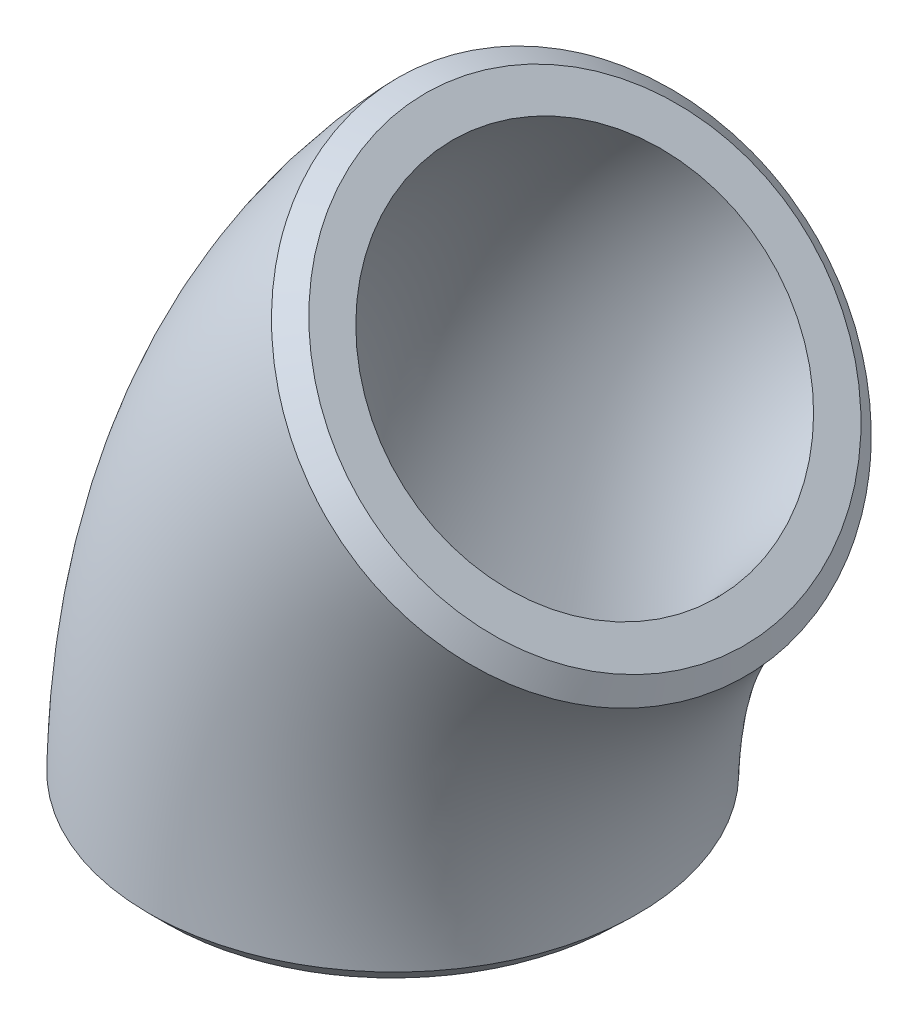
ISO-10303-21;
HEADER;
FILE_DESCRIPTION(('STEP AP214'),'2;1');
FILE_NAME('part.step','',(''),(''),'','','');
FILE_SCHEMA(('AUTOMOTIVE_DESIGN { 1 0 10303 214 1 1 1 1 }'));
ENDSEC;
DATA;
#1=APPLICATION_CONTEXT('core data for automotive mechanical design processes');
#2=APPLICATION_PROTOCOL_DEFINITION('international standard','automotive_design',2000,#1);
#3=PRODUCT_CONTEXT('',#1,'mechanical');
#4=PRODUCT('Part','Part','',(#3));
#5=PRODUCT_RELATED_PRODUCT_CATEGORY('part','',(#4));
#6=PRODUCT_DEFINITION_FORMATION('','',#4);
#7=PRODUCT_DEFINITION_CONTEXT('part definition',#1,'design');
#8=PRODUCT_DEFINITION('design','',#6,#7);
#9=PRODUCT_DEFINITION_SHAPE('','',#8);
#10=(LENGTH_UNIT() NAMED_UNIT(*) SI_UNIT(.MILLI.,.METRE.));
#11=(NAMED_UNIT(*) PLANE_ANGLE_UNIT() SI_UNIT($,.RADIAN.));
#12=(NAMED_UNIT(*) SI_UNIT($,.STERADIAN.) SOLID_ANGLE_UNIT());
#13=UNCERTAINTY_MEASURE_WITH_UNIT(LENGTH_MEASURE(1.E-05),#10,'distance_accuracy_value','');
#14=(GEOMETRIC_REPRESENTATION_CONTEXT(3) GLOBAL_UNCERTAINTY_ASSIGNED_CONTEXT((#13)) GLOBAL_UNIT_ASSIGNED_CONTEXT((#10,
#11,#12)) REPRESENTATION_CONTEXT('',''));
#15=CARTESIAN_POINT('',(0.,0.,0.));
#16=DIRECTION('',(0.,0.,1.));
#17=DIRECTION('',(1.,0.,0.));
#18=AXIS2_PLACEMENT_3D('',#15,#16,#17);
#19=CARTESIAN_POINT('',(0.,0.,0.));
#20=DIRECTION('',(0.,0.,1.));
#21=DIRECTION('',(1.,0.,0.));
#22=AXIS2_PLACEMENT_3D('',#19,#20,#21);
#23=TOROIDAL_SURFACE('',#22,153.289,57.15);
#24=CARTESIAN_POINT('',(-111.574796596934,105.216541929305,57.1499552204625));
#25=CARTESIAN_POINT('',(-108.936018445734,102.589893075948,57.1563707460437));
#26=CARTESIAN_POINT('',(-106.243992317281,99.9110875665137,56.7870361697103));
#27=CARTESIAN_POINT('',(-101.05405524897,94.7485708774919,55.3342497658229));
#28=CARTESIAN_POINT('',(-98.5288058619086,92.2376225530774,54.2620422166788));
#29=CARTESIAN_POINT('',(-93.604588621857,87.3433831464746,51.4011740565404));
#30=CARTESIAN_POINT('',(-91.2326385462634,84.9869806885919,49.6169363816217));
#31=CARTESIAN_POINT('',(-86.842190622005,80.6273316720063,45.4922938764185));
#32=CARTESIAN_POINT('',(-84.7847027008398,78.5853382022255,43.1294590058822));
#33=CARTESIAN_POINT('',(-80.9874750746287,74.8185139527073,37.7979378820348));
#34=CARTESIAN_POINT('',(-79.3048126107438,73.150288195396,34.9099259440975));
#35=CARTESIAN_POINT('',(-76.3607297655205,70.2326621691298,28.7359028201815));
#36=CARTESIAN_POINT('',(-75.0838249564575,68.9679338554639,25.39249038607));
#37=CARTESIAN_POINT('',(-73.0383442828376,66.9425902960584,18.4649223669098));
#38=CARTESIAN_POINT('',(-72.2683672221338,66.18054998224,14.9073281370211));
#39=CARTESIAN_POINT('',(-71.2206132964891,65.143723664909,7.58348322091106));
#40=CARTESIAN_POINT('',(-70.9515495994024,64.8775488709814,3.78848822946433));
#41=CARTESIAN_POINT('',(-70.9478208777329,64.8738600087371,-3.6545812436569));
#42=CARTESIAN_POINT('',(-71.1994247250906,65.1227603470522,-7.36133531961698));
#43=CARTESIAN_POINT('',(-72.2370365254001,66.1495418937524,-14.7584153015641));
#44=CARTESIAN_POINT('',(-73.0136639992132,66.9181606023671,-18.3588714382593));
#45=CARTESIAN_POINT('',(-75.0302701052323,68.9148987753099,-25.2328190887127));
#46=CARTESIAN_POINT('',(-76.285246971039,70.157880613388,-28.5565315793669));
#47=CARTESIAN_POINT('',(-79.2560762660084,73.1019678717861,-34.827819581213));
#48=CARTESIAN_POINT('',(-80.9343331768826,74.7658313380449,-37.7045791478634));
#49=CARTESIAN_POINT('',(-84.6636980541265,78.4652699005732,-42.9775642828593));
#50=CARTESIAN_POINT('',(-86.7536396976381,80.5394210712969,-45.4013952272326));
#51=CARTESIAN_POINT('',(-91.1586169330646,84.9134599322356,-49.5548109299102));
#52=CARTESIAN_POINT('',(-93.482815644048,87.2223947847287,-51.3143312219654));
#53=CARTESIAN_POINT('',(-98.39431739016,92.1039117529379,-54.1991925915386));
#54=CARTESIAN_POINT('',(-100.969099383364,94.6640801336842,-55.304276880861));
#55=CARTESIAN_POINT('',(-106.138535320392,99.8061720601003,-56.7634941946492));
#56=CARTESIAN_POINT('',(-108.779929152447,102.43455418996,-57.1401406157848));
#57=CARTESIAN_POINT('',(-116.786432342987,110.4041586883,-57.1694226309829));
#58=CARTESIAN_POINT('',(-122.128954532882,115.725479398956,-55.6545169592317));
#59=CARTESIAN_POINT('',(-129.4294908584,122.999749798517,-51.3979939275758));
#60=CARTESIAN_POINT('',(-131.791485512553,125.353724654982,-49.6239662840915));
#61=CARTESIAN_POINT('',(-136.225355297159,129.773191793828,-45.4456715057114));
#62=CARTESIAN_POINT('',(-138.261525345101,131.803081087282,-43.0840979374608));
#63=CARTESIAN_POINT('',(-141.998907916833,135.529312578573,-37.8239247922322));
#64=CARTESIAN_POINT('',(-143.715663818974,137.24116260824,-34.8756758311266));
#65=CARTESIAN_POINT('',(-146.65022360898,140.167542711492,-28.6756330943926));
#66=CARTESIAN_POINT('',(-147.896384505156,141.410343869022,-25.3986136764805));
#67=CARTESIAN_POINT('',(-149.94000511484,143.448537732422,-18.4565503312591));
#68=CARTESIAN_POINT('',(-150.717549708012,144.224067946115,-14.8361958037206));
#69=CARTESIAN_POINT('',(-151.747399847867,145.251263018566,-7.54293667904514));
#70=CARTESIAN_POINT('',(-152.013886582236,145.517072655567,-3.81643453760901));
#71=CARTESIAN_POINT('',(-152.017677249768,145.520853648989,3.73481472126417));
#72=CARTESIAN_POINT('',(-151.755903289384,145.259744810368,7.44788938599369));
#73=CARTESIAN_POINT('',(-150.735400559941,144.241872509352,14.74403643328));
#74=CARTESIAN_POINT('',(-149.957334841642,143.465822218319,18.3834669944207));
#75=CARTESIAN_POINT('',(-147.927421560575,141.441297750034,25.306959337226));
#76=CARTESIAN_POINT('',(-146.687148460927,140.204366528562,28.5872394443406));
#77=CARTESIAN_POINT('',(-143.751402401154,137.276799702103,34.8104302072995));
#78=CARTESIAN_POINT('',(-142.040242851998,135.570527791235,37.7568276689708));
#79=CARTESIAN_POINT('',(-138.314623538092,131.856017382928,43.0179410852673));
#80=CARTESIAN_POINT('',(-136.279273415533,129.826939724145,45.388335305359));
#81=CARTESIAN_POINT('',(-131.839159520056,125.40123893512,49.5854345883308));
#82=CARTESIAN_POINT('',(-129.491576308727,123.061618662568,51.3539969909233));
#83=CARTESIAN_POINT('',(-124.626298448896,118.213831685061,54.2060541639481));
#84=CARTESIAN_POINT('',(-122.072242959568,115.669438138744,55.3073418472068));
#85=CARTESIAN_POINT('',(-116.838290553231,110.456640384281,56.7808813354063));
#86=CARTESIAN_POINT('',(-114.213574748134,107.843190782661,57.1435396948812));
#87=CARTESIAN_POINT('',(-111.574796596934,105.216541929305,57.1499552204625));
#88=B_SPLINE_CURVE_WITH_KNOTS('',3,(#24,#25,#26,#27,#28,#29,#30,#31,#32,#33,#34,#35,#36,#37,#38,
#39,#40,#41,#42,#43,#44,#45,#46,#47,#48,#49,#50,#51,#52,#53,#54,#55,#56,#57,#58,#59,#60,#61,#62,
#63,#64,#65,#66,#67,#68,#69,#70,#71,#72,#73,#74,#75,#76,#77,#78,#79,#80,#81,#82,#83,#84,#85,#86,
#87),.UNSPECIFIED.,.T.,.F.,(4,2,2,2,2,2,2,2,2,2,2,2,2,2,2,2,2,2,2,2,2,2,2,2,2,2,2,2,2,2,2,4),
(-0.323639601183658,-0.313349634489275,-0.303059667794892,-0.292769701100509,-0.282479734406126,
-0.272189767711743,-0.26189980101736,-0.251609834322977,-0.241319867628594,-0.231029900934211,
-0.220739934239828,-0.210449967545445,-0.200160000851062,-0.189870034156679,-0.179580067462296,
-0.169290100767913,-0.15900013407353,-0.138420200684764,-0.128130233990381,-0.117840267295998,
-0.107550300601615,-0.0972603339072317,-0.0869703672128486,-0.0766804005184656,
-0.0663904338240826,-0.0561004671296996,-0.0458105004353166,-0.0355205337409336,
-0.0252305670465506,-0.0149406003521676,-0.00465063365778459,0.00563933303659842),.UNSPECIFIED.);
#89=CARTESIAN_POINT('',(-111.574796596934,105.216541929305,57.1499552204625));
#90=VERTEX_POINT('',#89);
#91=EDGE_CURVE('E46',#90,#90,#88,.F.);
#92=ORIENTED_EDGE('',*,*,#91,.T.);
#93=EDGE_LOOP('',(#92));
#94=FACE_BOUND('',#93,.T.);
#95=CARTESIAN_POINT('',(-153.294625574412,4.49596499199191,57.1499552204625));
#96=CARTESIAN_POINT('',(-154.229760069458,4.49812029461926,57.1490853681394));
#97=CARTESIAN_POINT('',(-155.164822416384,4.50023832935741,57.1247856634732));
#98=CARTESIAN_POINT('',(-157.037346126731,4.50441076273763,57.0300064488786));
#99=CARTESIAN_POINT('',(-157.974795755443,4.5064647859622,56.9592943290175));
#100=CARTESIAN_POINT('',(-159.845394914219,4.51049886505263,56.7723717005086));
#101=CARTESIAN_POINT('',(-160.778543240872,4.51247890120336,56.656149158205));
#102=CARTESIAN_POINT('',(-162.633767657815,4.51635352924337,56.3781968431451));
#103=CARTESIAN_POINT('',(-163.555874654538,4.51824846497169,56.2166738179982));
#104=CARTESIAN_POINT('',(-165.386230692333,4.52195219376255,55.8492273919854));
#105=CARTESIAN_POINT('',(-166.294526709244,4.52376138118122,55.6435376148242));
#106=CARTESIAN_POINT('',(-168.099331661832,4.52730408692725,55.1886921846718));
#107=CARTESIAN_POINT('',(-168.995850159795,4.52903766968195,54.939574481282));
#108=CARTESIAN_POINT('',(-170.777300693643,4.53243305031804,54.397108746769));
#109=CARTESIAN_POINT('',(-171.66220703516,4.53409470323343,54.1036762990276));
#110=CARTESIAN_POINT('',(-173.420831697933,4.53735127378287,53.4725064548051));
#111=CARTESIAN_POINT('',(-174.294476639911,4.53894583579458,53.134564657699));
#112=CARTESIAN_POINT('',(-176.027130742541,4.54206569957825,52.4148436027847));
#113=CARTESIAN_POINT('',(-176.88607761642,4.54359073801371,52.0329143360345));
#114=CARTESIAN_POINT('',(-178.583375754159,4.5465649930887,51.2274023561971));
#115=CARTESIAN_POINT('',(-179.421742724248,4.54801426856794,50.8038527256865));
#116=CARTESIAN_POINT('',(-181.074574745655,4.55083589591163,49.9174197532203));
#117=CARTESIAN_POINT('',(-181.889096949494,4.55220844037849,49.4546429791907));
#118=CARTESIAN_POINT('',(-183.490696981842,4.55487486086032,48.491656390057));
#119=CARTESIAN_POINT('',(-184.277882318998,4.55616906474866,47.9916254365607));
#120=CARTESIAN_POINT('',(-185.825132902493,4.55868392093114,46.9546329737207));
#121=CARTESIAN_POINT('',(-186.585251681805,4.55990472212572,46.4177513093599));
#122=CARTESIAN_POINT('',(-188.080385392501,4.56228009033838,45.3063787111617));
#123=CARTESIAN_POINT('',(-188.815333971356,4.56343448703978,44.7317985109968));
#124=CARTESIAN_POINT('',(-190.258925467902,4.56567843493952,43.5450443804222));
#125=CARTESIAN_POINT('',(-190.967457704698,4.56676772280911,42.9327357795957));
#126=CARTESIAN_POINT('',(-192.35714230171,4.56888310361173,41.6707260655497));
#127=CARTESIAN_POINT('',(-193.038133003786,4.56990883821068,41.0208469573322));
#128=CARTESIAN_POINT('',(-194.366836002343,4.57189181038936,39.6887904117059));
#129=CARTESIAN_POINT('',(-195.014570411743,4.57284909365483,39.0066350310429));
#130=CARTESIAN_POINT('',(-196.271755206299,4.57469083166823,37.6153120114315));
#131=CARTESIAN_POINT('',(-196.881411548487,4.57557568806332,36.9063305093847));
#132=CARTESIAN_POINT('',(-198.062812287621,4.57727621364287,35.4619354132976));
#133=CARTESIAN_POINT('',(-198.634691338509,4.57809213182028,34.7266319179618));
#134=CARTESIAN_POINT('',(-199.741269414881,4.57965910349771,33.2304100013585));
#135=CARTESIAN_POINT('',(-200.276027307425,4.58041026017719,32.4695351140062));
#136=CARTESIAN_POINT('',(-201.309496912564,4.58185214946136,30.919673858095));
#137=CARTESIAN_POINT('',(-201.808070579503,4.58254265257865,30.1305953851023));
#138=CARTESIAN_POINT('',(-202.768259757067,4.58386391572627,28.524624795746));
#139=CARTESIAN_POINT('',(-203.229666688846,4.58449434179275,27.7076080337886));
#140=CARTESIAN_POINT('',(-204.113004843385,4.58569421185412,26.0504874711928));
#141=CARTESIAN_POINT('',(-204.534858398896,4.58626353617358,25.2103422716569));
#142=CARTESIAN_POINT('',(-205.335917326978,4.587338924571,23.5113529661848));
#143=CARTESIAN_POINT('',(-205.715180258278,4.58784507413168,22.6525360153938));
#144=CARTESIAN_POINT('',(-206.429186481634,4.58879381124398,20.9210206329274));
#145=CARTESIAN_POINT('',(-206.764118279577,4.58923666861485,20.0483998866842));
#146=CARTESIAN_POINT('',(-207.389949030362,4.59006089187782,18.2908783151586));
#147=CARTESIAN_POINT('',(-207.680995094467,4.5904424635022,17.4060298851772));
#148=CARTESIAN_POINT('',(-208.219063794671,4.59114537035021,15.6236409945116));
#149=CARTESIAN_POINT('',(-208.466113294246,4.59146674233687,14.7261086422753));
#150=CARTESIAN_POINT('',(-208.916931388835,4.59205151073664,12.9181398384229));
#151=CARTESIAN_POINT('',(-209.120603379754,4.5923147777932,12.0076793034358));
#152=CARTESIAN_POINT('',(-209.483776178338,4.59278345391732,10.1732813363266));
#153=CARTESIAN_POINT('',(-209.643052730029,4.59298856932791,9.24929944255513));
#154=CARTESIAN_POINT('',(-209.916149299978,4.59333970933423,7.39176358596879));
#155=CARTESIAN_POINT('',(-210.029828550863,4.59348555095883,6.45818896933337));
#156=CARTESIAN_POINT('',(-210.211504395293,4.59371828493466,4.58771835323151));
#157=CARTESIAN_POINT('',(-210.279554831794,4.59380524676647,3.65082758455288));
#158=CARTESIAN_POINT('',(-210.368839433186,4.59391919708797,1.77991163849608));
#159=CARTESIAN_POINT('',(-210.390326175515,4.59394650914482,0.845898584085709));
#160=CARTESIAN_POINT('',(-210.387246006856,4.59394257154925,-1.01778544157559));
#161=CARTESIAN_POINT('',(-210.362888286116,4.59391158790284,-1.9474568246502));
#162=CARTESIAN_POINT('',(-210.269271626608,4.5937920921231,-3.80532293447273));
#163=CARTESIAN_POINT('',(-210.199974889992,4.59370353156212,-4.73351575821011));
#164=CARTESIAN_POINT('',(-210.015565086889,4.59346726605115,-6.58855253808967));
#165=CARTESIAN_POINT('',(-209.90029615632,4.59331935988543,-7.51538102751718));
#166=CARTESIAN_POINT('',(-209.623596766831,4.59296353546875,-9.36784931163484));
#167=CARTESIAN_POINT('',(-209.461891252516,4.59275525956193,-10.2934479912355));
#168=CARTESIAN_POINT('',(-209.092793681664,4.59227883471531,-12.1372075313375));
#169=CARTESIAN_POINT('',(-208.885320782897,4.59201057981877,-13.0553522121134));
#170=CARTESIAN_POINT('',(-208.426113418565,4.59141471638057,-14.876680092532));
#171=CARTESIAN_POINT('',(-208.174555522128,4.59108734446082,-15.7799078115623));
#172=CARTESIAN_POINT('',(-207.628319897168,4.5903734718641,-17.5697417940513));
#173=CARTESIAN_POINT('',(-207.333797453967,4.5899871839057,-18.456395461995));
#174=CARTESIAN_POINT('',(-206.702756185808,4.58915565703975,-20.211433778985));
#175=CARTESIAN_POINT('',(-206.366374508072,4.58871061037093,-21.0798677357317));
#176=CARTESIAN_POINT('',(-205.651243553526,4.58775980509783,-22.79973539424));
#177=CARTESIAN_POINT('',(-205.272468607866,4.5872540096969,-23.6511584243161));
#178=CARTESIAN_POINT('',(-204.472197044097,4.5861791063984,-25.3376499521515));
#179=CARTESIAN_POINT('',(-204.050543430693,4.58560976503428,-26.1726439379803));
#180=CARTESIAN_POINT('',(-203.165493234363,4.5844068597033,-27.8236439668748));
#181=CARTESIAN_POINT('',(-202.701967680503,4.58377309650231,-28.6395808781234));
#182=CARTESIAN_POINT('',(-201.733967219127,4.58244020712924,-30.2497238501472));
#183=CARTESIAN_POINT('',(-201.229387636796,4.58174091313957,-31.0438669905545));
#184=CARTESIAN_POINT('',(-200.18301561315,4.58027987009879,-32.6042752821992));
#185=CARTESIAN_POINT('',(-199.641322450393,4.57951828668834,-33.3706070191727));
#186=CARTESIAN_POINT('',(-198.524014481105,4.57793438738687,-34.8714560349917));
#187=CARTESIAN_POINT('',(-197.94860722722,4.57711243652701,-35.6061277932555));
#188=CARTESIAN_POINT('',(-196.764020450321,4.57540525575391,-37.0441723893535));
#189=CARTESIAN_POINT('',(-196.154942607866,4.5745202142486,-37.747629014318));
#190=CARTESIAN_POINT('',(-194.903631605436,4.57268521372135,-39.1242031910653));
#191=CARTESIAN_POINT('',(-194.261403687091,4.57173526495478,-39.7973255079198));
#192=CARTESIAN_POINT('',(-192.941366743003,4.56976347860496,-41.1145196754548));
#193=CARTESIAN_POINT('',(-192.263395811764,4.56874130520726,-41.7584293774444));
#194=CARTESIAN_POINT('',(-190.872845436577,4.56662258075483,-43.0152793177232));
#195=CARTESIAN_POINT('',(-190.160102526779,4.56552566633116,-43.6280385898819));
#196=CARTESIAN_POINT('',(-188.705284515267,4.56326207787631,-44.8185513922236));
#197=CARTESIAN_POINT('',(-187.963193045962,4.56209536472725,-45.3962849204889));
#198=CARTESIAN_POINT('',(-186.454349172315,4.55969533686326,-46.5119415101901));
#199=CARTESIAN_POINT('',(-185.687710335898,4.55846231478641,-47.0500180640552));
#200=CARTESIAN_POINT('',(-184.132792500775,4.55593113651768,-48.0849358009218));
#201=CARTESIAN_POINT('',(-183.344645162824,4.55463334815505,-48.5819749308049));
#202=CARTESIAN_POINT('',(-181.746247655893,4.5519684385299,-49.5367080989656));
#203=CARTESIAN_POINT('',(-180.936027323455,4.5506014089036,-49.9944520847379));
#204=CARTESIAN_POINT('',(-179.292852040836,4.54779240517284,-50.8702695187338));
#205=CARTESIAN_POINT('',(-178.459864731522,4.54635032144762,-51.2882822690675));
#206=CARTESIAN_POINT('',(-176.770875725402,4.54338681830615,-52.0849581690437));
#207=CARTESIAN_POINT('',(-175.914790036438,4.54186508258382,-52.4634432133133));
#208=CARTESIAN_POINT('',(-174.181700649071,4.53874087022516,-53.1792046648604));
#209=CARTESIAN_POINT('',(-173.304629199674,4.53713810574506,-53.5163170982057));
#210=CARTESIAN_POINT('',(-171.534948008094,4.53385664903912,-54.1467872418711));
#211=CARTESIAN_POINT('',(-170.642338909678,4.53217795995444,-54.4401467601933));
#212=CARTESIAN_POINT('',(-168.846018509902,4.52874922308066,-54.9822478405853));
#213=CARTESIAN_POINT('',(-167.942339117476,4.52699935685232,-55.2310951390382));
#214=CARTESIAN_POINT('',(-166.128171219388,4.52343194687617,-55.6828022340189));
#215=CARTESIAN_POINT('',(-165.217736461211,4.52161476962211,-55.8858777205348));
#216=CARTESIAN_POINT('',(-163.390234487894,4.51790906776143,-56.2465349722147));
#217=CARTESIAN_POINT('',(-162.473189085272,4.51602072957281,-56.404227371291));
#218=CARTESIAN_POINT('',(-160.630398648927,4.51216528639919,-56.6752840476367));
#219=CARTESIAN_POINT('',(-159.704638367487,4.51019800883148,-56.7885446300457));
#220=CARTESIAN_POINT('',(-157.84538306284,4.50618199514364,-56.9699911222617));
#221=CARTESIAN_POINT('',(-156.911872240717,4.50413299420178,-57.0380152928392));
#222=CARTESIAN_POINT('',(-155.038126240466,4.49995150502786,-57.128521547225));
#223=CARTESIAN_POINT('',(-154.097880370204,4.49781866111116,-57.1507819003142));
#224=CARTESIAN_POINT('',(-152.216576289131,4.49347756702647,-57.1491425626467));
#225=CARTESIAN_POINT('',(-151.27551811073,4.49126925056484,-57.1252012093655));
#226=CARTESIAN_POINT('',(-149.397808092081,4.48678494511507,-57.0307483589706));
#227=CARTESIAN_POINT('',(-148.461151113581,4.4845091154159,-56.9603392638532));
#228=CARTESIAN_POINT('',(-146.592170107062,4.47988721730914,-56.7731177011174));
#229=CARTESIAN_POINT('',(-145.659847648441,4.47754112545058,-56.6562895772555));
#230=CARTESIAN_POINT('',(-143.79943360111,4.47277610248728,-56.3764711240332));
#231=CARTESIAN_POINT('',(-142.871361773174,4.47035698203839,-56.2133495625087));
#232=CARTESIAN_POINT('',(-141.025138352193,4.46545753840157,-55.8419833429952));
#233=CARTESIAN_POINT('',(-140.106978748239,4.46297727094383,-55.6337785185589));
#234=CARTESIAN_POINT('',(-138.286868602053,4.45797094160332,-55.173414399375));
#235=CARTESIAN_POINT('',(-137.384858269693,4.45544518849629,-54.9214915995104));
#236=CARTESIAN_POINT('',(-135.597700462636,4.45035048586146,-54.3746058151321));
#237=CARTESIAN_POINT('',(-134.712502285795,4.44778173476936,-54.0798084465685));
#238=CARTESIAN_POINT('',(-132.959564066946,4.44260363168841,-53.4481611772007));
#239=CARTESIAN_POINT('',(-132.091788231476,4.43999438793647,-53.1114106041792));
#240=CARTESIAN_POINT('',(-130.372138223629,4.43472949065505,-52.3952246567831));
#241=CARTESIAN_POINT('',(-129.520296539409,4.43207376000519,-52.0157112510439));
#242=CARTESIAN_POINT('',(-127.83274835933,4.42671817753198,-51.2137639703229));
#243=CARTESIAN_POINT('',(-126.99712311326,4.42401818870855,-50.7911591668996));
#244=CARTESIAN_POINT('',(-125.345274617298,4.41858697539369,-49.9044956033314));
#245=CARTESIAN_POINT('',(-124.529109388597,4.4158556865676,-49.4403287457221));
#246=CARTESIAN_POINT('',(-122.919639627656,4.41037442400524,-48.4716671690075));
#247=CARTESIAN_POINT('',(-122.126365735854,4.40762443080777,-47.9671215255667));
#248=CARTESIAN_POINT('',(-120.568194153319,4.40212748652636,-46.9211981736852));
#249=CARTESIAN_POINT('',(-119.803213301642,4.39938055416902,-46.3799443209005));
#250=CARTESIAN_POINT('',(-118.304439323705,4.39390749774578,-45.2633516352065));
#251=CARTESIAN_POINT('',(-117.570510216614,4.39118133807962,-44.6881953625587));
#252=CARTESIAN_POINT('',(-116.133381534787,4.38575498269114,-43.5037624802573));
#253=CARTESIAN_POINT('',(-115.430119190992,4.38305474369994,-42.89456201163));
#254=CARTESIAN_POINT('',(-114.053389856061,4.37768473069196,-41.6425213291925));
#255=CARTESIAN_POINT('',(-113.379942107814,4.37501497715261,-40.9996599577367));
#256=CARTESIAN_POINT('',(-112.062024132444,4.36970786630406,-39.6781964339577));
#257=CARTESIAN_POINT('',(-111.41772237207,4.36707074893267,-38.9994261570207));
#258=CARTESIAN_POINT('',(-110.16047244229,4.36184749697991,-37.6076232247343));
#259=CARTESIAN_POINT('',(-109.547686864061,4.35926166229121,-36.8944437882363));
#260=CARTESIAN_POINT('',(-108.357519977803,4.35416870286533,-35.4392180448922));
#261=CARTESIAN_POINT('',(-107.780136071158,4.35166157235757,-34.6971738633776));
#262=CARTESIAN_POINT('',(-106.665611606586,4.34675548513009,-33.1889979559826));
#263=CARTESIAN_POINT('',(-106.128289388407,4.34435606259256,-32.4230005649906));
#264=CARTESIAN_POINT('',(-105.094798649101,4.33968106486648,-30.8694084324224));
#265=CARTESIAN_POINT('',(-104.598433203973,4.33740491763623,-30.0819445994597));
#266=CARTESIAN_POINT('',(-103.644533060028,4.33297987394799,-28.4842900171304));
#267=CARTESIAN_POINT('',(-103.186981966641,4.33083092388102,-27.6741090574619));
#268=CARTESIAN_POINT('',(-102.311185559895,4.32667256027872,-26.0303044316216));
#269=CARTESIAN_POINT('',(-101.893035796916,4.32466348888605,-25.1966298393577));
#270=CARTESIAN_POINT('',(-101.09591504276,4.32079489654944,-23.5054611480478));
#271=CARTESIAN_POINT('',(-100.717158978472,4.31893620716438,-22.647865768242));
#272=CARTESIAN_POINT('',(-100.001201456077,4.31539182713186,-20.9123557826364));
#273=CARTESIAN_POINT('',(-99.6641336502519,4.31370669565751,-20.0343860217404));
#274=CARTESIAN_POINT('',(-99.0343397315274,4.31053352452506,-18.2642859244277));
#275=CARTESIAN_POINT('',(-98.7415429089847,4.30904517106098,-17.3721807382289));
#276=CARTESIAN_POINT('',(-98.2008078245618,4.30627726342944,-15.5772839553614));
#277=CARTESIAN_POINT('',(-97.9527426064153,4.30499711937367,-14.6745306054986));
#278=CARTESIAN_POINT('',(-97.5023416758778,4.30265932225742,-12.861709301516));
#279=CARTESIAN_POINT('',(-97.2998181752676,4.30160075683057,-11.951688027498));
#280=CARTESIAN_POINT('',(-96.9399476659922,4.29971312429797,-10.1241288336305));
#281=CARTESIAN_POINT('',(-96.7825357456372,4.29888372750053,-9.20660368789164));
#282=CARTESIAN_POINT('',(-96.5121559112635,4.2974548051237,-7.36241034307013));
#283=CARTESIAN_POINT('',(-96.399313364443,4.29685592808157,-6.43572376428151));
#284=CARTESIAN_POINT('',(-96.2188720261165,4.29589554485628,-4.57447835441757));
#285=CARTESIAN_POINT('',(-96.1514427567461,4.29553492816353,-3.63990306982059));
#286=CARTESIAN_POINT('',(-96.0625049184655,4.29505816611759,-1.76418001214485));
#287=CARTESIAN_POINT('',(-96.0412131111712,4.29494317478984,-0.823021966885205));
#288=CARTESIAN_POINT('',(-96.0450584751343,4.29496372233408,1.05807186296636));
#289=CARTESIAN_POINT('',(-96.0701401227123,4.29509896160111,1.99800776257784));
#290=CARTESIAN_POINT('',(-96.1664486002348,4.29561492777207,3.8697723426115));
#291=CARTESIAN_POINT('',(-96.2373932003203,4.29599415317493,4.80161551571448));
#292=CARTESIAN_POINT('',(-96.4247989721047,4.29699113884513,6.65725416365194));
#293=CARTESIAN_POINT('',(-96.5410923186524,4.29760801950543,7.58106661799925));
#294=CARTESIAN_POINT('',(-96.8180770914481,4.29907112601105,9.4208000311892));
#295=CARTESIAN_POINT('',(-96.9787114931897,4.29991705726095,10.3367295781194));
#296=CARTESIAN_POINT('',(-97.3454690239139,4.30183943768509,12.1633677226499));
#297=CARTESIAN_POINT('',(-97.5517764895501,4.30291682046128,13.0740393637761));
#298=CARTESIAN_POINT('',(-98.0102960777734,4.3052943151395,14.8889881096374));
#299=CARTESIAN_POINT('',(-98.26275077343,4.30659560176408,15.7932038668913));
#300=CARTESIAN_POINT('',(-98.8118022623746,4.30940276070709,17.5897111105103));
#301=CARTESIAN_POINT('',(-99.1084689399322,4.31090895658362,18.4819812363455));
#302=CARTESIAN_POINT('',(-99.7449649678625,4.31411157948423,20.2488162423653));
#303=CARTESIAN_POINT('',(-100.08469923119,4.31580758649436,21.1234153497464));
#304=CARTESIAN_POINT('',(-100.805329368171,4.31936968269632,22.8506620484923));
#305=CARTESIAN_POINT('',(-101.186024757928,4.32123493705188,23.7033933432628));
#306=CARTESIAN_POINT('',(-101.987308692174,4.32511767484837,25.3868782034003));
#307=CARTESIAN_POINT('',(-102.407778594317,4.32713470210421,26.2176882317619));
#308=CARTESIAN_POINT('',(-103.289007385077,4.33131190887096,27.8575746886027));
#309=CARTESIAN_POINT('',(-103.749763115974,4.33347207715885,28.6666528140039));
#310=CARTESIAN_POINT('',(-104.711291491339,4.3379240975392,30.2636936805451));
#311=CARTESIAN_POINT('',(-105.212170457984,4.34021629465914,31.0515923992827));
#312=CARTESIAN_POINT('',(-106.25458764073,4.34492184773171,32.6054770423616));
#313=CARTESIAN_POINT('',(-106.796308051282,4.34733572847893,33.3713408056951));
#314=CARTESIAN_POINT('',(-107.918246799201,4.35226350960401,34.8771308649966));
#315=CARTESIAN_POINT('',(-108.498553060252,4.35477763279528,35.616991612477));
#316=CARTESIAN_POINT('',(-109.693594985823,4.35987951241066,37.06648154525));
#317=CARTESIAN_POINT('',(-110.30827711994,4.36246715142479,37.7761548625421));
#318=CARTESIAN_POINT('',(-111.568640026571,4.36769064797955,39.1604197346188));
#319=CARTESIAN_POINT('',(-112.214134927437,4.37032616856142,39.835180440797));
#320=CARTESIAN_POINT('',(-113.534743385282,4.3756311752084,41.1493368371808));
#321=CARTESIAN_POINT('',(-114.209720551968,4.3783004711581,41.7888696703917));
#322=CARTESIAN_POINT('',(-115.590565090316,4.38367338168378,43.0353406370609));
#323=CARTESIAN_POINT('',(-116.29646767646,4.38637703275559,43.6422397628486));
#324=CARTESIAN_POINT('',(-117.739810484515,4.39181316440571,44.8228112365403));
#325=CARTESIAN_POINT('',(-118.477355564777,4.39454571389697,45.3963554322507));
#326=CARTESIAN_POINT('',(-119.984284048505,4.40003375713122,46.5099702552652));
#327=CARTESIAN_POINT('',(-120.75383467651,4.40278928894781,47.0498145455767));
#328=CARTESIAN_POINT('',(-122.319602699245,4.40829734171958,48.0917174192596));
#329=CARTESIAN_POINT('',(-123.115854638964,4.4110498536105,48.5937240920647));
#330=CARTESIAN_POINT('',(-124.728575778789,4.41652652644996,49.5556156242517));
#331=CARTESIAN_POINT('',(-125.544938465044,4.41925075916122,50.0156790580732));
#332=CARTESIAN_POINT('',(-127.196255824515,4.42466444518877,50.8935337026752));
#333=CARTESIAN_POINT('',(-128.031131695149,4.42735398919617,51.3114731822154));
#334=CARTESIAN_POINT('',(-129.717831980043,4.43269183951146,52.1050133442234));
#335=CARTESIAN_POINT('',(-130.569600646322,4.43534024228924,52.4807325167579));
#336=CARTESIAN_POINT('',(-132.291543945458,4.44059813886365,53.1904688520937));
#337=CARTESIAN_POINT('',(-133.161739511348,4.44320758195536,53.5244352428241));
#338=CARTESIAN_POINT('',(-134.921015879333,4.44838967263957,54.1506361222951));
#339=CARTESIAN_POINT('',(-135.810159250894,4.4509621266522,54.4426947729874));
#340=CARTESIAN_POINT('',(-137.604329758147,4.45606183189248,54.9838631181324));
#341=CARTESIAN_POINT('',(-138.509396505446,4.45858892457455,55.232841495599));
#342=CARTESIAN_POINT('',(-140.332496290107,4.46358908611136,55.6863265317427));
#343=CARTESIAN_POINT('',(-141.250551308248,4.46606203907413,55.8907448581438));
#344=CARTESIAN_POINT('',(-143.092917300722,4.47093684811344,56.2535366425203));
#345=CARTESIAN_POINT('',(-144.017202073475,4.47333889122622,56.4120432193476));
#346=CARTESIAN_POINT('',(-145.867511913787,4.47806432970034,56.6827345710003));
#347=CARTESIAN_POINT('',(-146.793501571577,4.48038807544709,56.795161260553));
#348=CARTESIAN_POINT('',(-148.647523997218,4.48496122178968,56.9741660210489));
#349=CARTESIAN_POINT('',(-149.575545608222,4.48721079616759,57.0408597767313));
#350=CARTESIAN_POINT('',(-151.433933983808,4.49164052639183,57.1291632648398));
#351=CARTESIAN_POINT('',(-152.364301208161,4.49382066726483,57.1507633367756));
#352=CARTESIAN_POINT('',(-153.294625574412,4.49596499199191,57.1499552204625));
#353=B_SPLINE_CURVE_WITH_KNOTS('',3,(#95,#96,#97,#98,#99,#100,#101,#102,#103,#104,#105,#106,
#107,#108,#109,#110,#111,#112,#113,#114,#115,#116,#117,#118,#119,#120,#121,#122,#123,#124,#125,
#126,#127,#128,#129,#130,#131,#132,#133,#134,#135,#136,#137,#138,#139,#140,#141,#142,#143,#144,
#145,#146,#147,#148,#149,#150,#151,#152,#153,#154,#155,#156,#157,#158,#159,#160,#161,#162,#163,
#164,#165,#166,#167,#168,#169,#170,#171,#172,#173,#174,#175,#176,#177,#178,#179,#180,#181,#182,
#183,#184,#185,#186,#187,#188,#189,#190,#191,#192,#193,#194,#195,#196,#197,#198,#199,#200,#201,
#202,#203,#204,#205,#206,#207,#208,#209,#210,#211,#212,#213,#214,#215,#216,#217,#218,#219,#220,
#221,#222,#223,#224,#225,#226,#227,#228,#229,#230,#231,#232,#233,#234,#235,#236,#237,#238,#239,
#240,#241,#242,#243,#244,#245,#246,#247,#248,#249,#250,#251,#252,#253,#254,#255,#256,#257,#258,
#259,#260,#261,#262,#263,#264,#265,#266,#267,#268,#269,#270,#271,#272,#273,#274,#275,#276,#277,
#278,#279,#280,#281,#282,#283,#284,#285,#286,#287,#288,#289,#290,#291,#292,#293,#294,#295,#296,
#297,#298,#299,#300,#301,#302,#303,#304,#305,#306,#307,#308,#309,#310,#311,#312,#313,#314,#315,
#316,#317,#318,#319,#320,#321,#322,#323,#324,#325,#326,#327,#328,#329,#330,#331,#332,#333,#334,
#335,#336,#337,#338,#339,#340,#341,#342,#343,#344,#345,#346,#347,#348,#349,#350,#351,#352),
.UNSPECIFIED.,.F.,.F.,(4,2,2,2,2,2,2,2,2,2,2,2,2,2,2,2,2,2,2,2,2,2,2,2,2,2,2,2,2,2,2,2,2,2,2,2,
2,2,2,2,2,2,2,2,2,2,2,2,2,2,2,2,2,2,2,2,2,2,2,2,2,2,2,2,2,2,2,2,2,2,2,2,2,2,2,2,2,2,2,2,2,2,2,2,
2,2,2,2,2,2,2,2,2,2,2,2,2,2,2,2,2,2,2,2,2,2,2,2,2,2,2,2,2,2,2,2,2,2,2,2,2,2,2,2,2,2,2,2,4),(0.,
2.80504309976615,5.62425298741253,8.44420882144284,11.2514983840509,14.0442891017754,
16.83465145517,19.6303979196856,22.4394627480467,25.2584079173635,28.0751302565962,
30.8844316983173,33.6810209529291,36.4717312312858,39.2693063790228,42.0775216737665,
44.9003497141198,47.7212758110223,50.5253159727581,53.3187519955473,56.1076518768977,
58.9066860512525,61.7204686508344,64.5396655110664,67.35500533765,70.157960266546,
72.9512997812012,75.7429278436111,78.5407094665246,81.3523775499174,84.172660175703,
86.9896089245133,89.7912389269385,92.5801159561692,95.3713417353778,98.1721124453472,
100.989827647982,103.812560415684,106.624235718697,109.425989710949,112.218794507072,
115.013299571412,117.818432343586,120.632520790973,123.454023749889,126.268253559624,
129.066681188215,131.857076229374,134.647031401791,137.450941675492,140.269619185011,
143.089891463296,145.898602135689,148.692859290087,151.483510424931,154.278358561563,
157.085300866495,159.903031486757,162.720645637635,165.531475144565,168.328768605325,
171.119183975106,173.916073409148,176.722909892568,179.54331405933,182.366262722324,
185.18301107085,188.000710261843,190.826478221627,193.649759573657,196.458218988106,
199.256104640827,202.047487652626,204.84404934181,207.652170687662,210.467820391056,
213.287078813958,216.09725746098,218.893484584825,221.683690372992,224.475671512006,
227.282137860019,230.101869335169,232.921393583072,235.727238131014,238.518692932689,
241.308962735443,244.105833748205,246.917241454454,249.73744091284,252.553087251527,
255.360611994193,258.156338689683,260.948022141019,263.747503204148,266.557377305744,
269.380424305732,272.200093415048,275.002574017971,277.79478024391,280.583412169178,
283.383511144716,286.198775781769,289.018538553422,291.832180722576,294.632629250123,
297.424973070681,300.217098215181,303.016883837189,305.82999683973,308.64975550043,
311.465239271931,314.265477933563,317.05390722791,319.845598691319,322.6473900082,
325.466328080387,328.289065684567,331.099161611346,333.898993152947,336.690759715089,
339.485888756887,342.292422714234,345.107366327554,347.92784031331,350.74005268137,
353.537306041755,356.327457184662,359.118206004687),.UNSPECIFIED.);
#354=CARTESIAN_POINT('',(-153.294625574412,4.49596499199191,57.1499552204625));
#355=VERTEX_POINT('',#354);
#356=EDGE_CURVE('E51',#355,#355,#353,.F.);
#357=ORIENTED_EDGE('',*,*,#356,.T.);
#358=EDGE_LOOP('',(#357));
#359=FACE_BOUND('',#358,.T.);
#360=ADVANCED_FACE('F34',(#94,#359),#23,.T.);
#361=CARTESIAN_POINT('',(-108.391691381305,108.391691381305,0.));
#362=DIRECTION('',(0.707106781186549,0.707106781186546,0.));
#363=DIRECTION('',(0.,0.,1.));
#364=AXIS2_PLACEMENT_3D('',#361,#362,#363);
#365=PLANE('',#364);
#366=CARTESIAN_POINT('',(-108.391691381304,108.391691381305,52.6541587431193));
#367=CARTESIAN_POINT('',(-109.017166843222,109.017166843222,52.6527165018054));
#368=CARTESIAN_POINT('',(-109.642634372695,109.642634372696,52.6292860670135));
#369=CARTESIAN_POINT('',(-110.892092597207,110.892092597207,52.5381523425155));
#370=CARTESIAN_POINT('',(-111.516082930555,111.516082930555,52.4704391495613));
#371=CARTESIAN_POINT('',(-112.762789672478,112.762789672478,52.2901625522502));
#372=CARTESIAN_POINT('',(-113.385496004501,113.385496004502,52.1774596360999));
#373=CARTESIAN_POINT('',(-114.629808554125,114.629808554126,51.9069580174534));
#374=CARTESIAN_POINT('',(-115.251385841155,115.251385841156,51.7488932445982));
#375=CARTESIAN_POINT('',(-116.489006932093,116.489006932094,51.3879673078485));
#376=CARTESIAN_POINT('',(-117.105040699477,117.105040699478,51.1850372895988));
#377=CARTESIAN_POINT('',(-118.327321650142,118.327321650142,50.7357021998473));
#378=CARTESIAN_POINT('',(-118.93359104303,118.93359104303,50.4894179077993));
#379=CARTESIAN_POINT('',(-120.134505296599,120.134505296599,49.9547047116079));
#380=CARTESIAN_POINT('',(-120.72918261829,120.729182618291,49.6664216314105));
#381=CARTESIAN_POINT('',(-121.905156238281,121.905156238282,49.0487439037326));
#382=CARTESIAN_POINT('',(-122.486495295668,122.486495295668,48.7195120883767));
#383=CARTESIAN_POINT('',(-123.637234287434,123.637234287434,48.0196926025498));
#384=CARTESIAN_POINT('',(-124.206622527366,124.206622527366,47.6490664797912));
#385=CARTESIAN_POINT('',(-125.333377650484,125.333377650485,46.8664170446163));
#386=CARTESIAN_POINT('',(-125.890697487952,125.890697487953,46.4542582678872));
#387=CARTESIAN_POINT('',(-126.991978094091,126.991978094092,45.5889353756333));
#388=CARTESIAN_POINT('',(-127.535879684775,127.535879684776,45.13562060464));
#389=CARTESIAN_POINT('',(-128.608474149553,128.608474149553,44.1888190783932));
#390=CARTESIAN_POINT('',(-129.137109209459,129.13710920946,43.6952013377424));
#391=CARTESIAN_POINT('',(-130.173279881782,130.173279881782,42.6732170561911));
#392=CARTESIAN_POINT('',(-130.680909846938,130.680909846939,42.1450418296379));
#393=CARTESIAN_POINT('',(-131.673946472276,131.673946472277,41.0555871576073));
#394=CARTESIAN_POINT('',(-132.159453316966,132.159453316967,40.4944903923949));
#395=CARTESIAN_POINT('',(-133.108650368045,133.108650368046,39.3396609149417));
#396=CARTESIAN_POINT('',(-133.572389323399,133.5723893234,38.7460082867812));
#397=CARTESIAN_POINT('',(-134.478992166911,134.478992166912,37.5260959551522));
#398=CARTESIAN_POINT('',(-134.921829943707,134.921829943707,36.8997974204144));
#399=CARTESIAN_POINT('',(-135.787017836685,135.787017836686,35.6116486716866));
#400=CARTESIAN_POINT('',(-136.209214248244,136.209214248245,34.949591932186));
#401=CARTESIAN_POINT('',(-137.030867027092,137.030867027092,33.5941235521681));
#402=CARTESIAN_POINT('',(-137.430245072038,137.430245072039,32.9006170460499));
#403=CARTESIAN_POINT('',(-138.203238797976,138.203238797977,31.4868033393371));
#404=CARTESIAN_POINT('',(-138.576885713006,138.576885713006,30.7665303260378));
#405=CARTESIAN_POINT('',(-139.295587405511,139.295587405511,29.3032815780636));
#406=CARTESIAN_POINT('',(-139.640774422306,139.640774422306,28.5604357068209));
#407=CARTESIAN_POINT('',(-140.303281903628,140.303281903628,27.0538649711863));
#408=CARTESIAN_POINT('',(-140.620694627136,140.620694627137,26.2902212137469));
#409=CARTESIAN_POINT('',(-141.227635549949,141.227635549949,24.7414722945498));
#410=CARTESIAN_POINT('',(-141.517174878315,141.517174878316,23.9563758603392));
#411=CARTESIAN_POINT('',(-142.0686205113,142.068620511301,22.3644752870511));
#412=CARTESIAN_POINT('',(-142.330452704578,142.330452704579,21.5576198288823));
#413=CARTESIAN_POINT('',(-142.826227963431,142.826227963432,19.9223870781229));
#414=CARTESIAN_POINT('',(-143.060032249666,143.060032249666,19.0939255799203));
#415=CARTESIAN_POINT('',(-143.497804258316,143.497804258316,17.4191571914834));
#416=CARTESIAN_POINT('',(-143.70169999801,143.70169999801,16.5728126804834));
#417=CARTESIAN_POINT('',(-144.078865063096,144.078865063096,14.8677503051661));
#418=CARTESIAN_POINT('',(-144.252172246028,144.252172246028,14.0090491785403));
#419=CARTESIAN_POINT('',(-144.566882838,144.566882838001,12.2844819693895));
#420=CARTESIAN_POINT('',(-144.708437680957,144.708437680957,11.4186712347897));
#421=CARTESIAN_POINT('',(-144.95949378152,144.95949378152,9.68201106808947));
#422=CARTESIAN_POINT('',(-145.06914104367,145.06914104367,8.8112037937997));
#423=CARTESIAN_POINT('',(-145.257765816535,145.257765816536,7.06178252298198));
#424=CARTESIAN_POINT('',(-145.336702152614,145.336702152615,6.183159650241));
#425=CARTESIAN_POINT('',(-145.463226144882,145.463226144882,4.41806712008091));
#426=CARTESIAN_POINT('',(-145.510694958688,145.510694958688,3.53158038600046));
#427=CARTESIAN_POINT('',(-145.573972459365,145.573972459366,1.75086649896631));
#428=CARTESIAN_POINT('',(-145.589583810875,145.589583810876,0.856625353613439));
#429=CARTESIAN_POINT('',(-145.588656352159,145.588656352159,-0.932533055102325));
#430=CARTESIAN_POINT('',(-145.572092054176,145.572092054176,-1.82745029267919));
#431=CARTESIAN_POINT('',(-145.506841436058,145.506841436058,-3.61026621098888));
#432=CARTESIAN_POINT('',(-145.458322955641,145.458322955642,-4.49817716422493));
#433=CARTESIAN_POINT('',(-145.329698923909,145.32969892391,-6.2659845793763));
#434=CARTESIAN_POINT('',(-145.249714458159,145.24971445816,-7.1458986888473));
#435=CARTESIAN_POINT('',(-145.058863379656,145.058863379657,-8.89683421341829));
#436=CARTESIAN_POINT('',(-144.948071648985,144.948071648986,-9.76787194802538));
#437=CARTESIAN_POINT('',(-144.695025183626,144.695025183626,-11.5033966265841));
#438=CARTESIAN_POINT('',(-144.552680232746,144.552680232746,-12.3678572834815));
#439=CARTESIAN_POINT('',(-144.236569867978,144.236569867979,-14.0892037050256));
#440=CARTESIAN_POINT('',(-144.062670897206,144.062670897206,-14.9460403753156));
#441=CARTESIAN_POINT('',(-143.684080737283,143.684080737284,-16.6482882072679));
#442=CARTESIAN_POINT('',(-143.479315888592,143.479315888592,-17.4936666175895));
#443=CARTESIAN_POINT('',(-143.039383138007,143.039383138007,-19.1688084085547));
#444=CARTESIAN_POINT('',(-142.80420404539,142.804204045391,-19.9985659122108));
#445=CARTESIAN_POINT('',(-142.305575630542,142.305575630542,-21.6361979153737));
#446=CARTESIAN_POINT('',(-142.042267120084,142.042267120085,-22.4441581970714));
#447=CARTESIAN_POINT('',(-141.488143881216,141.488143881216,-24.0368504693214));
#448=CARTESIAN_POINT('',(-141.19744736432,141.19744736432,-24.8216646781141));
#449=CARTESIAN_POINT('',(-140.588660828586,140.588660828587,-26.3685711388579));
#450=CARTESIAN_POINT('',(-140.270602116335,140.270602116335,-27.1306880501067));
#451=CARTESIAN_POINT('',(-139.607381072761,139.607381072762,-28.6332873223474));
#452=CARTESIAN_POINT('',(-139.262161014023,139.262161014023,-29.3737187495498));
#453=CARTESIAN_POINT('',(-138.543001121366,138.543001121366,-30.8330489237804));
#454=CARTESIAN_POINT('',(-138.168895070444,138.168895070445,-31.55178391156));
#455=CARTESIAN_POINT('',(-137.394530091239,137.39453009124,-32.9635341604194));
#456=CARTESIAN_POINT('',(-136.994204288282,136.994204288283,-33.6564759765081));
#457=CARTESIAN_POINT('',(-136.170371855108,136.170371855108,-35.0113197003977));
#458=CARTESIAN_POINT('',(-135.746924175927,135.746924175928,-35.6732932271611));
#459=CARTESIAN_POINT('',(-134.879169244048,134.879169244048,-36.9611441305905));
#460=CARTESIAN_POINT('',(-134.435014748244,134.435014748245,-37.587227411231));
#461=CARTESIAN_POINT('',(-133.526276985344,133.526276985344,-38.8058867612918));
#462=CARTESIAN_POINT('',(-133.061744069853,133.061744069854,-39.398537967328));
#463=CARTESIAN_POINT('',(-132.11150000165,132.111500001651,-40.5506638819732));
#464=CARTESIAN_POINT('',(-131.625762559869,131.62576255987,-41.1100952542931));
#465=CARTESIAN_POINT('',(-130.632782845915,130.632782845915,-42.1957803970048));
#466=CARTESIAN_POINT('',(-130.125457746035,130.125457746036,-42.7218826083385));
#467=CARTESIAN_POINT('',(-129.089935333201,129.089935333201,-43.7399198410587));
#468=CARTESIAN_POINT('',(-128.561641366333,128.561641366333,-44.2316582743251));
#469=CARTESIAN_POINT('',(-127.48839729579,127.48839729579,-45.1758580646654));
#470=CARTESIAN_POINT('',(-126.943461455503,126.943461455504,-45.6283518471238));
#471=CARTESIAN_POINT('',(-125.839607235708,125.839607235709,-46.4925501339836));
#472=CARTESIAN_POINT('',(-125.280731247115,125.280731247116,-46.9043629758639));
#473=CARTESIAN_POINT('',(-124.151298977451,124.151298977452,-47.6858935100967));
#474=CARTESIAN_POINT('',(-123.580800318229,123.58080031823,-48.0557776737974));
#475=CARTESIAN_POINT('',(-122.428751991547,122.428751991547,-48.7529211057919));
#476=CARTESIAN_POINT('',(-121.847236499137,121.847236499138,-49.0802932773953));
#477=CARTESIAN_POINT('',(-120.671287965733,120.671287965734,-49.6937503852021));
#478=CARTESIAN_POINT('',(-120.07681926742,120.076819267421,-49.9796985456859));
#479=CARTESIAN_POINT('',(-118.876720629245,118.876720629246,-50.509720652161));
#480=CARTESIAN_POINT('',(-118.271063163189,118.271063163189,-50.7536698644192));
#481=CARTESIAN_POINT('',(-117.050462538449,117.05046253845,-51.1987894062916));
#482=CARTESIAN_POINT('',(-116.435501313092,116.435501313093,-51.399860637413));
#483=CARTESIAN_POINT('',(-115.198185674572,115.198185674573,-51.7583785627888));
#484=CARTESIAN_POINT('',(-114.575820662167,114.575820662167,-51.9157521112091));
#485=CARTESIAN_POINT('',(-113.325587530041,113.325587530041,-52.1859837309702));
#486=CARTESIAN_POINT('',(-112.6977141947,112.6977141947,-52.2987935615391));
#487=CARTESIAN_POINT('',(-111.438359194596,111.438359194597,-52.4791275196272));
#488=CARTESIAN_POINT('',(-110.806875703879,110.80687570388,-52.5466262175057));
#489=CARTESIAN_POINT('',(-109.542190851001,109.542190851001,-52.6351353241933));
#490=CARTESIAN_POINT('',(-108.908989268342,108.908989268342,-52.6561394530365));
#491=CARTESIAN_POINT('',(-107.644249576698,107.644249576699,-52.6520837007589));
#492=CARTESIAN_POINT('',(-107.012711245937,107.012711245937,-52.6271382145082));
#493=CARTESIAN_POINT('',(-105.753972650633,105.753972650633,-52.5327269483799));
#494=CARTESIAN_POINT('',(-105.126765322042,105.126765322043,-52.4634493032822));
#495=CARTESIAN_POINT('',(-103.877629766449,103.87762976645,-52.2804656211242));
#496=CARTESIAN_POINT('',(-103.255691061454,103.255691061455,-52.1669027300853));
#497=CARTESIAN_POINT('',(-102.017942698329,102.017942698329,-51.8961171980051));
#498=CARTESIAN_POINT('',(-101.402122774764,101.402122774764,-51.7389884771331));
#499=CARTESIAN_POINT('',(-100.174664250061,100.174664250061,-51.3798539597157));
#500=CARTESIAN_POINT('',(-99.5630497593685,99.5630497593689,-51.1776832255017));
#501=CARTESIAN_POINT('',(-98.344942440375,98.3449424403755,-50.7288434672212));
#502=CARTESIAN_POINT('',(-97.7384878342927,97.7384878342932,-50.48196726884));
#503=CARTESIAN_POINT('',(-96.5341134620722,96.5341134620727,-49.944946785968));
#504=CARTESIAN_POINT('',(-95.9362096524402,95.9362096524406,-49.6547308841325));
#505=CARTESIAN_POINT('',(-94.7525570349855,94.752557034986,-49.0317831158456));
#506=CARTESIAN_POINT('',(-94.1667919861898,94.1667919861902,-48.6991129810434));
#507=CARTESIAN_POINT('',(-93.0106911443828,93.0106911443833,-47.9939705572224));
#508=CARTESIAN_POINT('',(-92.440294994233,92.4402949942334,-47.6216960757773));
#509=CARTESIAN_POINT('',(-91.3153154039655,91.3153154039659,-46.8380859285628));
#510=CARTESIAN_POINT('',(-90.7606876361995,90.7606876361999,-46.4268776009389));
#511=CARTESIAN_POINT('',(-89.6669584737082,89.6669584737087,-45.5653897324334));
#512=CARTESIAN_POINT('',(-89.1278542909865,89.127854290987,-45.1151172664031));
#513=CARTESIAN_POINT('',(-88.0645628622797,88.0645628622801,-44.1758111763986));
#514=CARTESIAN_POINT('',(-87.5404247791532,87.5404247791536,-43.6866661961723));
#515=CARTESIAN_POINT('',(-86.5077486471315,86.5077486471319,-42.6681139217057));
#516=CARTESIAN_POINT('',(-85.9993133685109,85.9993133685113,-42.1384981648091));
#517=CARTESIAN_POINT('',(-85.0010694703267,85.0010694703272,-41.0427240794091));
#518=CARTESIAN_POINT('',(-84.5112963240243,84.5112963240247,-40.4765011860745));
#519=CARTESIAN_POINT('',(-83.5539616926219,83.5539616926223,-39.3116213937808));
#520=CARTESIAN_POINT('',(-83.0863380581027,83.0863380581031,-38.7130667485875));
#521=CARTESIAN_POINT('',(-82.1766364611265,82.1766364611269,-37.4866432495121));
#522=CARTESIAN_POINT('',(-81.7344095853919,81.7344095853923,-36.8589952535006));
#523=CARTESIAN_POINT('',(-80.8732912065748,80.8732912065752,-35.5744391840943));
#524=CARTESIAN_POINT('',(-80.4543624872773,80.4543624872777,-34.9175809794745));
#525=CARTESIAN_POINT('',(-79.6396499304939,79.6396499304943,-33.5734596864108));
#526=CARTESIAN_POINT('',(-79.2439140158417,79.2439140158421,-32.8861384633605));
#527=CARTESIAN_POINT('',(-78.4757033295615,78.4757033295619,-31.4806193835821));
#528=CARTESIAN_POINT('',(-78.1033512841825,78.1033512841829,-30.7622874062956));
#529=CARTESIAN_POINT('',(-77.3828994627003,77.3828994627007,-29.2960683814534));
#530=CARTESIAN_POINT('',(-77.0349379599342,77.0349379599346,-28.5480454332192));
#531=CARTESIAN_POINT('',(-76.3673354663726,76.367335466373,-27.0297042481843));
#532=CARTESIAN_POINT('',(-76.0476264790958,76.0476264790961,-26.2594458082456));
#533=CARTESIAN_POINT('',(-75.4373108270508,75.4373108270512,-24.699641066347));
#534=CARTESIAN_POINT('',(-75.1466085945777,75.146608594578,-23.9101695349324));
#535=CARTESIAN_POINT('',(-74.5948201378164,74.5948201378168,-22.3142992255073));
#536=CARTESIAN_POINT('',(-74.3336313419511,74.3336313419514,-21.5079713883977));
#537=CARTESIAN_POINT('',(-73.8408789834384,73.8408789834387,-19.8790135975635));
#538=CARTESIAN_POINT('',(-73.6092663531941,73.6092663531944,-19.0564133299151));
#539=CARTESIAN_POINT('',(-73.1749384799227,73.174938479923,-17.3929431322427));
#540=CARTESIAN_POINT('',(-72.9723233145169,72.9723233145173,-16.552020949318));
#541=CARTESIAN_POINT('',(-72.5967225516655,72.5967225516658,-14.8537863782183));
#542=CARTESIAN_POINT('',(-72.4238439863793,72.4238439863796,-13.996426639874));
#543=CARTESIAN_POINT('',(-72.1085739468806,72.1085739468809,-12.2673629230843));
#544=CARTESIAN_POINT('',(-71.9662913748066,71.966291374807,-11.3956192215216));
#545=CARTESIAN_POINT('',(-71.7134519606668,71.7134519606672,-9.64379508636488));
#546=CARTESIAN_POINT('',(-71.6028667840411,71.6028667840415,-8.76372282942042));
#547=CARTESIAN_POINT('',(-71.4141103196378,71.4141103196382,-7.0022650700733));
#548=CARTESIAN_POINT('',(-71.3357411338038,71.3357411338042,-6.12092200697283));
#549=CARTESIAN_POINT('',(-71.2110651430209,71.2110651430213,-4.35681505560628));
#550=CARTESIAN_POINT('',(-71.164647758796,71.1646477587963,-3.47406677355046));
#551=CARTESIAN_POINT('',(-71.1030557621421,71.1030557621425,-1.7069770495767));
#552=CARTESIAN_POINT('',(-71.0878606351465,71.0878606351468,-0.822637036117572));
#553=CARTESIAN_POINT('',(-71.089201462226,71.0892014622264,0.950355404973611));
#554=CARTESIAN_POINT('',(-71.1058937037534,71.1058937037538,1.83900767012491));
#555=CARTESIAN_POINT('',(-71.1714665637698,71.1714665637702,3.61877591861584));
#556=CARTESIAN_POINT('',(-71.2205221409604,71.2205221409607,4.50987892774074));
#557=CARTESIAN_POINT('',(-71.3502278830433,71.3502278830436,6.28805977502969));
#558=CARTESIAN_POINT('',(-71.4308984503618,71.4308984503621,7.1751346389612));
#559=CARTESIAN_POINT('',(-71.6240167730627,71.624016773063,8.93864463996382));
#560=CARTESIAN_POINT('',(-71.7363335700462,71.7363335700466,9.81510841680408));
#561=CARTESIAN_POINT('',(-71.9916614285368,71.9916614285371,11.5546294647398));
#562=CARTESIAN_POINT('',(-72.1345220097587,72.1345220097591,12.4177309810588));
#563=CARTESIAN_POINT('',(-72.45051577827,72.4505157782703,14.1315226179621));
#564=CARTESIAN_POINT('',(-72.6236072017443,72.6236072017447,14.9822281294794));
#565=CARTESIAN_POINT('',(-73.0003890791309,73.0003890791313,16.6715040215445));
#566=CARTESIAN_POINT('',(-73.2041291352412,73.2041291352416,17.5100522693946));
#567=CARTESIAN_POINT('',(-73.6420715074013,73.6420715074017,19.1754218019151));
#568=CARTESIAN_POINT('',(-73.8764078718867,73.8764078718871,20.0021725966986));
#569=CARTESIAN_POINT('',(-74.3755475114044,74.3755475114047,21.6403915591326));
#570=CARTESIAN_POINT('',(-74.6404510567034,74.6404510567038,22.4517986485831));
#571=CARTESIAN_POINT('',(-75.198982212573,75.1989822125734,24.0544527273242));
#572=CARTESIAN_POINT('',(-75.4926062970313,75.4926062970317,24.8457021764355));
#573=CARTESIAN_POINT('',(-76.1067285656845,76.1067285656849,26.4037685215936));
#574=CARTESIAN_POINT('',(-76.4271380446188,76.4271380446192,27.1706552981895));
#575=CARTESIAN_POINT('',(-77.0935087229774,77.0935087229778,28.6758568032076));
#576=CARTESIAN_POINT('',(-77.4393150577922,77.4393150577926,29.4143086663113));
#577=CARTESIAN_POINT('',(-78.1563776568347,78.1563776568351,30.8653712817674));
#578=CARTESIAN_POINT('',(-78.5276178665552,78.5276178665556,31.5779979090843));
#579=CARTESIAN_POINT('',(-79.2960749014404,79.2960749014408,32.9778800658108));
#580=CARTESIAN_POINT('',(-79.6933615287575,79.6933615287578,33.6650589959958));
#581=CARTESIAN_POINT('',(-80.5140551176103,80.5140551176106,35.0133382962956));
#582=CARTESIAN_POINT('',(-80.9375802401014,80.9375802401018,35.674294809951));
#583=CARTESIAN_POINT('',(-81.8099829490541,81.8099829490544,36.9682539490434));
#584=CARTESIAN_POINT('',(-82.2589779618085,82.2589779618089,37.6010982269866));
#585=CARTESIAN_POINT('',(-83.177067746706,83.1770677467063,38.8307535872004));
#586=CARTESIAN_POINT('',(-83.6460600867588,83.6460600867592,39.4277176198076));
#587=CARTESIAN_POINT('',(-84.6026574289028,84.6026574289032,40.5843649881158));
#588=CARTESIAN_POINT('',(-85.0901638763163,85.0901638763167,41.1442113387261));
#589=CARTESIAN_POINT('',(-86.083061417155,86.0830614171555,42.2267792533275));
#590=CARTESIAN_POINT('',(-86.5883953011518,86.5883953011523,42.7496058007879));
#591=CARTESIAN_POINT('',(-87.61700424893,87.6170042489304,43.758935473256));
#592=CARTESIAN_POINT('',(-88.1402819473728,88.1402819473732,44.2454332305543));
#593=CARTESIAN_POINT('',(-89.2064809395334,89.2064809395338,45.182541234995));
#594=CARTESIAN_POINT('',(-89.7494909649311,89.7494909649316,45.6329495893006));
#595=CARTESIAN_POINT('',(-90.8526404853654,90.8526404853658,46.4960047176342));
#596=CARTESIAN_POINT('',(-91.4128304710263,91.4128304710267,46.9085223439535));
#597=CARTESIAN_POINT('',(-92.5477116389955,92.5477116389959,47.6931980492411));
#598=CARTESIAN_POINT('',(-93.1224136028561,93.1224136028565,48.0653249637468));
#599=CARTESIAN_POINT('',(-94.2829567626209,94.2829567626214,48.7665024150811));
#600=CARTESIAN_POINT('',(-94.8687633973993,94.8687633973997,49.0956673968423));
#601=CARTESIAN_POINT('',(-96.0484385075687,96.0484385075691,49.710308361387));
#602=CARTESIAN_POINT('',(-96.6422528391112,96.6422528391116,49.9959922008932));
#603=CARTESIAN_POINT('',(-97.8380927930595,97.83809279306,50.5238102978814));
#604=CARTESIAN_POINT('',(-98.4400982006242,98.4400982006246,50.7660361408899));
#605=CARTESIAN_POINT('',(-99.6524350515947,99.6524350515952,51.2077492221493));
#606=CARTESIAN_POINT('',(-100.262773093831,100.262773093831,51.4072002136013));
#607=CARTESIAN_POINT('',(-101.492724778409,101.492724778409,51.7632047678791));
#608=CARTESIAN_POINT('',(-102.112368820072,102.112368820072,51.9195486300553));
#609=CARTESIAN_POINT('',(-103.359411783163,103.359411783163,52.1878450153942));
#610=CARTESIAN_POINT('',(-103.986833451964,103.986833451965,52.2995857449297));
#611=CARTESIAN_POINT('',(-105.244686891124,105.244686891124,52.4784193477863));
#612=CARTESIAN_POINT('',(-105.875117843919,105.87511784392,52.5455237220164));
#613=CARTESIAN_POINT('',(-107.134264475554,107.134264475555,52.6339731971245));
#614=CARTESIAN_POINT('',(-107.762971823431,107.762971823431,52.6555563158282));
#615=CARTESIAN_POINT('',(-108.391691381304,108.391691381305,52.6541587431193));
#616=B_SPLINE_CURVE_WITH_KNOTS('',3,(#366,#367,#368,#369,#370,#371,#372,#373,#374,#375,#376,
#377,#378,#379,#380,#381,#382,#383,#384,#385,#386,#387,#388,#389,#390,#391,#392,#393,#394,#395,
#396,#397,#398,#399,#400,#401,#402,#403,#404,#405,#406,#407,#408,#409,#410,#411,#412,#413,#414,
#415,#416,#417,#418,#419,#420,#421,#422,#423,#424,#425,#426,#427,#428,#429,#430,#431,#432,#433,
#434,#435,#436,#437,#438,#439,#440,#441,#442,#443,#444,#445,#446,#447,#448,#449,#450,#451,#452,
#453,#454,#455,#456,#457,#458,#459,#460,#461,#462,#463,#464,#465,#466,#467,#468,#469,#470,#471,
#472,#473,#474,#475,#476,#477,#478,#479,#480,#481,#482,#483,#484,#485,#486,#487,#488,#489,#490,
#491,#492,#493,#494,#495,#496,#497,#498,#499,#500,#501,#502,#503,#504,#505,#506,#507,#508,#509,
#510,#511,#512,#513,#514,#515,#516,#517,#518,#519,#520,#521,#522,#523,#524,#525,#526,#527,#528,
#529,#530,#531,#532,#533,#534,#535,#536,#537,#538,#539,#540,#541,#542,#543,#544,#545,#546,#547,
#548,#549,#550,#551,#552,#553,#554,#555,#556,#557,#558,#559,#560,#561,#562,#563,#564,#565,#566,
#567,#568,#569,#570,#571,#572,#573,#574,#575,#576,#577,#578,#579,#580,#581,#582,#583,#584,#585,
#586,#587,#588,#589,#590,#591,#592,#593,#594,#595,#596,#597,#598,#599,#600,#601,#602,#603,#604,
#605,#606,#607,#608,#609,#610,#611,#612,#613,#614,#615),.UNSPECIFIED.,.F.,.F.,(4,2,2,2,2,2,2,2,
2,2,2,2,2,2,2,2,2,2,2,2,2,2,2,2,2,2,2,2,2,2,2,2,2,2,2,2,2,2,2,2,2,2,2,2,2,2,2,2,2,2,2,2,2,2,2,2,
2,2,2,2,2,2,2,2,2,2,2,2,2,2,2,2,2,2,2,2,2,2,2,2,2,2,2,2,2,2,2,2,2,2,2,2,2,2,2,2,2,2,2,2,2,2,2,2,
2,2,2,2,2,2,2,2,2,2,2,2,2,2,2,2,2,2,2,2,4),(0.,2.65343710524,5.3074678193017,7.96979334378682,
10.6480656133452,13.3304770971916,16.0055306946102,18.6715083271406,21.3272047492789,
23.9853889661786,26.6525425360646,29.3298867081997,32.016307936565,34.6889436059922,
37.3479411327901,40.0006680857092,42.6566257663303,45.330031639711,48.0121216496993,
50.6908963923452,53.3564258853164,56.0127354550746,58.6679799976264,61.3301562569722,
64.0050127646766,66.686204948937,69.3640551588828,72.0288489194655,74.6812499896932,
77.3371950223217,80.0031143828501,82.6854977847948,85.3700068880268,88.0405268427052,
90.7008692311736,93.3548009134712,96.0164208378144,98.6895810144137,101.369224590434,
104.049856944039,106.717648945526,109.374412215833,112.028175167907,114.687739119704,
117.36394753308,120.047269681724,122.724043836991,125.383492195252,128.036703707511,
130.693303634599,133.361225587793,136.04333610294,138.723209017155,141.395741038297,
144.057260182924,146.711559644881,149.374432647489,152.045082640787,154.721839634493,
157.403050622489,160.087156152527,162.772766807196,165.458740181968,168.138035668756,
170.806035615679,173.465482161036,176.119239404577,178.78287890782,181.459193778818,
184.139981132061,186.816913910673,189.4810539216,192.136763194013,194.791992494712,
197.45512308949,200.133039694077,202.815815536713,205.490553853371,208.147544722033,
210.80016165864,213.458079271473,216.128946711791,218.813901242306,221.492207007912,
224.161375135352,226.820961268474,229.476076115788,232.140144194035,234.813609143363,
237.496437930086,240.176860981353,242.840563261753,245.494999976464,248.147692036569,
250.813418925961,253.493676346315,256.175666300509,258.846716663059,261.504898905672,
264.159437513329,266.818319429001,269.489267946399,272.169241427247,274.848886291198,
277.519984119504,280.175965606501,282.830285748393,285.492035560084,288.166793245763,
290.855083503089,293.530955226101,296.194167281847,298.849496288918,301.505216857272,
304.174884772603,306.853338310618,309.533844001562,312.207056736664,314.867059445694,
317.521388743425,320.177958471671,322.847232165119,325.52903402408,328.210144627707,
330.877201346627),.UNSPECIFIED.);
#617=CARTESIAN_POINT('',(-108.391691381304,108.391691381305,52.6541587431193));
#618=VERTEX_POINT('',#617);
#619=EDGE_CURVE('E56',#618,#618,#616,.F.);
#620=ORIENTED_EDGE('',*,*,#619,.T.);
#621=EDGE_LOOP('',(#620));
#622=FACE_BOUND('',#621,.T.);
#623=CARTESIAN_POINT('',(-108.391691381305,108.391691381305,0.));
#624=DIRECTION('',(0.707106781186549,0.707106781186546,0.));
#625=DIRECTION('',(-0.707106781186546,0.707106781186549,0.));
#626=AXIS2_PLACEMENT_3D('',#623,#624,#625);
#627=CIRCLE('',#626,43.6626);
#628=CARTESIAN_POINT('',(-139.26581192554,139.265811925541,0.));
#629=VERTEX_POINT('',#628);
#630=EDGE_CURVE('E61',#629,#629,#627,.T.);
#631=ORIENTED_EDGE('',*,*,#630,.F.);
#632=EDGE_LOOP('',(#631));
#633=FACE_BOUND('',#632,.T.);
#634=ADVANCED_FACE('F77',(#622,#633),#365,.T.);
#635=CARTESIAN_POINT('',(-153.289,0.,0.));
#636=DIRECTION('',(0.,1.,0.));
#637=DIRECTION('',(0.,0.,1.));
#638=AXIS2_PLACEMENT_3D('',#635,#636,#637);
#639=PLANE('',#638);
#640=CARTESIAN_POINT('',(-153.289,0.,52.6541587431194));
#641=CARTESIAN_POINT('',(-149.856713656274,0.,52.6568444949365));
#642=CARTESIAN_POINT('',(-146.444036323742,0.,52.3308876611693));
#643=CARTESIAN_POINT('',(-139.639135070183,0.,50.9918672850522));
#644=CARTESIAN_POINT('',(-136.31020615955,0.,49.9847917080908));
#645=CARTESIAN_POINT('',(-129.975305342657,0.,47.3732149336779));
#646=CARTESIAN_POINT('',(-126.920905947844,0.,45.7543825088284));
#647=CARTESIAN_POINT('',(-121.13142284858,0.,41.9020357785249));
#648=CARTESIAN_POINT('',(-118.475927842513,0.,39.724293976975));
#649=CARTESIAN_POINT('',(-113.616000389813,0.,34.891999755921));
#650=CARTESIAN_POINT('',(-111.383357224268,0.,32.1865807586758));
#651=CARTESIAN_POINT('',(-107.542889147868,0.,26.4593998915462));
#652=CARTESIAN_POINT('',(-105.920784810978,0.,23.4417180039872));
#653=CARTESIAN_POINT('',(-103.262675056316,0.,17.0768051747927));
#654=CARTESIAN_POINT('',(-102.238866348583,0.,13.7229629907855));
#655=CARTESIAN_POINT('',(-100.89166140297,0.,7.0036735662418));
#656=CARTESIAN_POINT('',(-100.541683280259,0.,3.58639195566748));
#657=CARTESIAN_POINT('',(-100.527194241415,0.,-3.36879515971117));
#658=CARTESIAN_POINT('',(-100.864955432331,0.,-6.80746767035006));
#659=CARTESIAN_POINT('',(-102.188233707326,0.,-13.5304998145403));
#660=CARTESIAN_POINT('',(-103.189791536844,0.,-16.8639111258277));
#661=CARTESIAN_POINT('',(-105.834940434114,0.,-23.2720692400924));
#662=CARTESIAN_POINT('',(-107.449828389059,0.,-26.2955872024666));
#663=CARTESIAN_POINT('',(-111.251707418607,0.,-32.014139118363));
#664=CARTESIAN_POINT('',(-113.478423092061,0.,-34.7363344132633));
#665=CARTESIAN_POINT('',(-118.331263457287,0.,-39.5980140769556));
#666=CARTESIAN_POINT('',(-120.974460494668,0.,-41.7799106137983));
#667=CARTESIAN_POINT('',(-126.727407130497,0.,-45.6423069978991));
#668=CARTESIAN_POINT('',(-129.796860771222,0.,-47.2865672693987));
#669=CARTESIAN_POINT('',(-136.12506601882,0.,-49.9208242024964));
#670=CARTESIAN_POINT('',(-139.422557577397,0.,-50.9341666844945));
#671=CARTESIAN_POINT('',(-146.245533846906,0.,-52.3059960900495));
#672=CARTESIAN_POINT('',(-149.687648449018,0.,-52.6511937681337));
#673=CARTESIAN_POINT('',(-156.63793866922,0.,-52.6571373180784));
#674=CARTESIAN_POINT('',(-160.07078985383,0.,-52.3184966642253));
#675=CARTESIAN_POINT('',(-166.792964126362,0.,-50.9932419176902));
#676=CARTESIAN_POINT('',(-170.136850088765,0.,-49.9864657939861));
#677=CARTESIAN_POINT('',(-176.531140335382,0.,-47.3443622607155));
#678=CARTESIAN_POINT('',(-179.554182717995,0.,-45.7308208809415));
#679=CARTESIAN_POINT('',(-185.280226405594,0.,-41.9226429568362));
#680=CARTESIAN_POINT('',(-188.000818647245,0.,-39.6957961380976));
#681=CARTESIAN_POINT('',(-192.8557854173,0.,-34.8479563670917));
#682=CARTESIAN_POINT('',(-195.039112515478,0.,-32.2036464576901));
#683=CARTESIAN_POINT('',(-198.905460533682,0.,-26.4393639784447));
#684=CARTESIAN_POINT('',(-200.543387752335,0.,-23.3771319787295));
#685=CARTESIAN_POINT('',(-203.173868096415,0.,-17.0501268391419));
#686=CARTESIAN_POINT('',(-204.188199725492,0.,-13.7399746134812));
#687=CARTESIAN_POINT('',(-205.552150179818,0.,-6.92462488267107));
#688=CARTESIAN_POINT('',(-205.887213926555,0.,-3.5088704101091));
#689=CARTESIAN_POINT('',(-205.900904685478,0.,3.34658835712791));
#690=CARTESIAN_POINT('',(-205.562448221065,0.,6.84167617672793));
#691=CARTESIAN_POINT('',(-204.222557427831,0.,13.5985661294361));
#692=CARTESIAN_POINT('',(-203.233172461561,0.,16.8787959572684));
#693=CARTESIAN_POINT('',(-200.602114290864,0.,23.263457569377));
#694=CARTESIAN_POINT('',(-198.953350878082,0.,26.3527604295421));
#695=CARTESIAN_POINT('',(-195.150246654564,0.,32.0524204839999));
#696=CARTESIAN_POINT('',(-192.976887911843,0.,34.7170712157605));
#697=CARTESIAN_POINT('',(-188.063393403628,0.,39.6429944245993));
#698=CARTESIAN_POINT('',(-185.395515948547,0.,41.8302677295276));
#699=CARTESIAN_POINT('',(-179.704387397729,0.,45.6458797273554));
#700=CARTESIAN_POINT('',(-176.632803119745,0.,47.2959215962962));
#701=CARTESIAN_POINT('',(-170.236739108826,0.,49.951430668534));
#702=CARTESIAN_POINT('',(-166.957520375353,0.,50.9471650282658));
#703=CARTESIAN_POINT('',(-160.220538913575,0.,52.3020087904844));
#704=CARTESIAN_POINT('',(-156.721286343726,0.,52.6514729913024));
#705=CARTESIAN_POINT('',(-153.289,0.,52.6541587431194));
#706=B_SPLINE_CURVE_WITH_KNOTS('',3,(#640,#641,#642,#643,#644,#645,#646,#647,#648,#649,#650,
#651,#652,#653,#654,#655,#656,#657,#658,#659,#660,#661,#662,#663,#664,#665,#666,#667,#668,#669,
#670,#671,#672,#673,#674,#675,#676,#677,#678,#679,#680,#681,#682,#683,#684,#685,#686,#687,#688,
#689,#690,#691,#692,#693,#694,#695,#696,#697,#698,#699,#700,#701,#702,#703,#704,#705),
.UNSPECIFIED.,.T.,.F.,(4,2,2,2,2,2,2,2,2,2,2,2,2,2,2,2,2,2,2,2,2,2,2,2,2,2,2,2,2,2,2,2,4),
(0.0053779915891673,0.0156681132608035,0.0259582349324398,0.036248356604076,0.0465384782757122,
0.0568285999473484,0.0671187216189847,0.0774088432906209,0.0876989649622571,0.0979890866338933,
0.10827920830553,0.118569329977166,0.128859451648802,0.139149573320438,0.149439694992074,
0.159729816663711,0.170019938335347,0.180310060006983,0.190600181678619,0.200890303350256,
0.211180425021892,0.221470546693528,0.231760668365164,0.242050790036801,0.252340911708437,
0.262631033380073,0.272921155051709,0.283211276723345,0.293501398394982,0.303791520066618,
0.314081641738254,0.32437176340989,0.334661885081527),.UNSPECIFIED.);
#707=CARTESIAN_POINT('',(-153.289,0.,52.6541587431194));
#708=VERTEX_POINT('',#707);
#709=EDGE_CURVE('E10',#708,#708,#706,.F.);
#710=ORIENTED_EDGE('',*,*,#709,.T.);
#711=EDGE_LOOP('',(#710));
#712=FACE_BOUND('',#711,.T.);
#713=CARTESIAN_POINT('',(-153.289,0.,0.));
#714=DIRECTION('',(0.,1.,0.));
#715=DIRECTION('',(0.,0.,1.));
#716=AXIS2_PLACEMENT_3D('',#713,#714,#715);
#717=CIRCLE('',#716,43.6626);
#718=CARTESIAN_POINT('',(-196.9516,0.,0.));
#719=VERTEX_POINT('',#718);
#720=EDGE_CURVE('E66',#719,#719,#717,.T.);
#721=ORIENTED_EDGE('',*,*,#720,.T.);
#722=EDGE_LOOP('',(#721));
#723=FACE_BOUND('',#722,.T.);
#724=ADVANCED_FACE('F87',(#712,#723),#639,.F.);
#725=CARTESIAN_POINT('',(0.,0.,0.));
#726=DIRECTION('',(0.,0.,1.));
#727=DIRECTION('',(1.,0.,0.));
#728=AXIS2_PLACEMENT_3D('',#725,#726,#727);
#729=TOROIDAL_SURFACE('',#728,153.289,43.6626);
#730=CARTESIAN_POINT('',(0.,0.,0.));
#731=DIRECTION('',(0.,0.,1.));
#732=DIRECTION('',(1.,0.,0.));
#733=AXIS2_PLACEMENT_3D('',#730,#731,#732);
#734=CIRCLE('',#733,196.9516);
#735=EDGE_CURVE('',#629,#719,#734,.T.);
#736=ORIENTED_EDGE('',*,*,#630,.T.);
#737=ORIENTED_EDGE('',*,*,#720,.F.);
#738=ORIENTED_EDGE('',*,*,#735,.T.);
#739=ORIENTED_EDGE('',*,*,#735,.F.);
#740=EDGE_LOOP('',(#736,#738,#737,#739));
#741=FACE_BOUND('',#740,.T.);
#742=ADVANCED_FACE('F150',(#741),#729,.F.);
#743=CARTESIAN_POINT('',(-108.391691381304,108.391691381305,52.6541587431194));
#744=CARTESIAN_POINT('',(-105.965920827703,105.965920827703,52.6600695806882));
#745=CARTESIAN_POINT('',(-103.491573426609,103.491573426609,52.319789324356));
#746=CARTESIAN_POINT('',(-98.7221458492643,98.7221458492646,50.9812887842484));
#747=CARTESIAN_POINT('',(-96.4019233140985,96.4019233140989,49.9934282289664));
#748=CARTESIAN_POINT('',(-91.878421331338,91.8784213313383,47.3576150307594));
#749=CARTESIAN_POINT('',(-89.6999763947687,89.699976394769,45.71373738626));
#750=CARTESIAN_POINT('',(-85.6685839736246,85.6685839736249,41.9135667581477));
#751=CARTESIAN_POINT('',(-83.7798217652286,83.7798217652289,39.736608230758));
#752=CARTESIAN_POINT('',(-80.2947724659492,80.2947724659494,34.8245001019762));
#753=CARTESIAN_POINT('',(-78.7508634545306,78.7508634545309,32.1636784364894));
#754=CARTESIAN_POINT('',(-76.0500690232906,76.0500690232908,26.4753451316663));
#755=CARTESIAN_POINT('',(-74.8789862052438,74.878986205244,23.3949478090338));
#756=CARTESIAN_POINT('',(-73.0032942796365,73.0032942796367,17.0123484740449));
#757=CARTESIAN_POINT('',(-72.2973841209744,72.2973841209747,13.7346183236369));
#758=CARTESIAN_POINT('',(-71.33686463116,71.3368646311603,6.98691587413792));
#759=CARTESIAN_POINT('',(-71.0902383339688,71.090238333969,3.49046048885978));
#760=CARTESIAN_POINT('',(-71.0868204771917,71.086820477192,-3.3670875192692));
#761=CARTESIAN_POINT('',(-71.3174420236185,71.3174420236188,-6.78224360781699));
#762=CARTESIAN_POINT('',(-72.2686601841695,72.2686601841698,-13.5974199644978));
#763=CARTESIAN_POINT('',(-72.9806659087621,72.9806659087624,-16.9146402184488));
#764=CARTESIAN_POINT('',(-74.8298735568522,74.8298735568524,-23.2478373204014));
#765=CARTESIAN_POINT('',(-75.980833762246,75.9808337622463,-26.3100844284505));
#766=CARTESIAN_POINT('',(-78.7061450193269,78.7061450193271,-32.0880311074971));
#767=CARTESIAN_POINT('',(-80.2460141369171,80.2460141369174,-34.7384855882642));
#768=CARTESIAN_POINT('',(-83.6687510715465,83.6687510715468,-39.5966625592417));
#769=CARTESIAN_POINT('',(-85.5872831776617,85.587283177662,-41.8298188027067));
#770=CARTESIAN_POINT('',(-89.6320003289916,89.6320003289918,-45.6564991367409));
#771=CARTESIAN_POINT('',(-91.7665767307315,91.7665767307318,-47.2776038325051));
#772=CARTESIAN_POINT('',(-96.2783610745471,96.2783610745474,-49.9355227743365));
#773=CARTESIAN_POINT('',(-98.6440805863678,98.6440805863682,-50.9536737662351));
#774=CARTESIAN_POINT('',(-103.394654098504,103.394654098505,-52.2980993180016));
#775=CARTESIAN_POINT('',(-105.822445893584,105.822445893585,-52.6451162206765));
#776=CARTESIAN_POINT('',(-113.18260524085,113.18260524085,-52.6720947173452));
#777=CARTESIAN_POINT('',(-118.095346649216,118.095346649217,-51.2763616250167));
#778=CARTESIAN_POINT('',(-124.809788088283,124.809788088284,-47.3546850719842));
#779=CARTESIAN_POINT('',(-126.982371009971,126.982371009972,-45.7202142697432));
#780=CARTESIAN_POINT('',(-131.060971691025,131.060971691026,-41.8706120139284));
#781=CARTESIAN_POINT('',(-132.934139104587,132.934139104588,-39.694815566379));
#782=CARTESIAN_POINT('',(-136.37249860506,136.37249860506,-34.848442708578));
#783=CARTESIAN_POINT('',(-137.951995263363,137.951995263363,-32.1321226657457));
#784=CARTESIAN_POINT('',(-140.65202089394,140.652020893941,-26.4198166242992));
#785=CARTESIAN_POINT('',(-141.798637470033,141.798637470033,-23.400589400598));
#786=CARTESIAN_POINT('',(-143.679049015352,143.679049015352,-17.0046350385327));
#787=CARTESIAN_POINT('',(-144.39451921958,144.394519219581,-13.6690817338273));
#788=CARTESIAN_POINT('',(-145.342158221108,145.342158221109,-6.94955899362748));
#789=CARTESIAN_POINT('',(-145.587376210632,145.587376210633,-3.51620835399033));
#790=CARTESIAN_POINT('',(-145.590864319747,145.590864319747,3.44100929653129));
#791=CARTESIAN_POINT('',(-145.349982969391,145.349982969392,6.86198875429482));
#792=CARTESIAN_POINT('',(-144.410944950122,144.410944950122,13.5841722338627));
#793=CARTESIAN_POINT('',(-143.694995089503,143.694995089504,16.9373009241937));
#794=CARTESIAN_POINT('',(-141.82719548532,141.827195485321,23.3161452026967));
#795=CARTESIAN_POINT('',(-140.685995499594,140.685995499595,26.3383766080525));
#796=CARTESIAN_POINT('',(-137.984876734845,137.984876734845,32.0720096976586));
#797=CARTESIAN_POINT('',(-136.410527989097,136.410527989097,34.7866238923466));
#798=CARTESIAN_POINT('',(-132.982987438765,132.982987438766,39.6338630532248));
#799=CARTESIAN_POINT('',(-131.110571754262,131.110571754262,41.8177862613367));
#800=CARTESIAN_POINT('',(-127.026222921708,127.026222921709,45.6847137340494));
#801=CARTESIAN_POINT('',(-124.866892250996,124.866892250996,47.3141492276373));
#802=CARTESIAN_POINT('',(-120.392198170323,120.392198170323,49.9418445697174));
#803=CARTESIAN_POINT('',(-118.043394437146,118.043394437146,50.9564976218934));
#804=CARTESIAN_POINT('',(-113.230656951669,113.23065695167,52.314118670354));
#805=CARTESIAN_POINT('',(-110.817461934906,110.817461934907,52.6482479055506));
#806=CARTESIAN_POINT('',(-108.391691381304,108.391691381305,52.6541587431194));
#807=CARTESIAN_POINT('',(-111.574796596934,105.216541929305,57.1499552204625));
#808=CARTESIAN_POINT('',(-108.936018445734,102.589893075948,57.1563707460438));
#809=CARTESIAN_POINT('',(-106.243992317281,99.9110875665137,56.7870361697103));
#810=CARTESIAN_POINT('',(-101.05405524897,94.7485708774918,55.3342497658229));
#811=CARTESIAN_POINT('',(-98.5288058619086,92.2376225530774,54.2620422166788));
#812=CARTESIAN_POINT('',(-93.604588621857,87.3433831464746,51.4011740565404));
#813=CARTESIAN_POINT('',(-91.2326385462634,84.9869806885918,49.6169363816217));
#814=CARTESIAN_POINT('',(-86.842190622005,80.6273316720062,45.4922938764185));
#815=CARTESIAN_POINT('',(-84.7847027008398,78.5853382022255,43.1294590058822));
#816=CARTESIAN_POINT('',(-80.9874750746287,74.8185139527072,37.7979378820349));
#817=CARTESIAN_POINT('',(-79.3048126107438,73.150288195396,34.9099259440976));
#818=CARTESIAN_POINT('',(-76.3607297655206,70.2326621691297,28.7359028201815));
#819=CARTESIAN_POINT('',(-75.0838249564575,68.9679338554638,25.39249038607));
#820=CARTESIAN_POINT('',(-73.0383442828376,66.9425902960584,18.4649223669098));
#821=CARTESIAN_POINT('',(-72.2683672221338,66.18054998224,14.9073281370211));
#822=CARTESIAN_POINT('',(-71.2206132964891,65.1437236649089,7.58348322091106));
#823=CARTESIAN_POINT('',(-70.9515495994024,64.8775488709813,3.78848822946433));
#824=CARTESIAN_POINT('',(-70.9478208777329,64.873860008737,-3.65458124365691));
#825=CARTESIAN_POINT('',(-71.1994247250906,65.1227603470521,-7.36133531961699));
#826=CARTESIAN_POINT('',(-72.2370365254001,66.1495418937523,-14.7584153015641));
#827=CARTESIAN_POINT('',(-73.0136639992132,66.9181606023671,-18.3588714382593));
#828=CARTESIAN_POINT('',(-75.0302701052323,68.9148987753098,-25.2328190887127));
#829=CARTESIAN_POINT('',(-76.285246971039,70.1578806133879,-28.5565315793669));
#830=CARTESIAN_POINT('',(-79.2560762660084,73.1019678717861,-34.827819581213));
#831=CARTESIAN_POINT('',(-80.9343331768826,74.7658313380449,-37.7045791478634));
#832=CARTESIAN_POINT('',(-84.6636980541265,78.4652699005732,-42.9775642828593));
#833=CARTESIAN_POINT('',(-86.7536396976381,80.5394210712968,-45.4013952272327));
#834=CARTESIAN_POINT('',(-91.1586169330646,84.9134599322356,-49.5548109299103));
#835=CARTESIAN_POINT('',(-93.482815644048,87.2223947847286,-51.3143312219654));
#836=CARTESIAN_POINT('',(-98.39431739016,92.1039117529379,-54.1991925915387));
#837=CARTESIAN_POINT('',(-100.969099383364,94.6640801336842,-55.304276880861));
#838=CARTESIAN_POINT('',(-106.138535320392,99.8061720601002,-56.7634941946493));
#839=CARTESIAN_POINT('',(-108.779929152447,102.43455418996,-57.1401406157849));
#840=CARTESIAN_POINT('',(-116.786432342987,110.4041586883,-57.169422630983));
#841=CARTESIAN_POINT('',(-122.128954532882,115.725479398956,-55.6545169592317));
#842=CARTESIAN_POINT('',(-129.4294908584,122.999749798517,-51.3979939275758));
#843=CARTESIAN_POINT('',(-131.791485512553,125.353724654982,-49.6239662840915));
#844=CARTESIAN_POINT('',(-136.225355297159,129.773191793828,-45.4456715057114));
#845=CARTESIAN_POINT('',(-138.261525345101,131.803081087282,-43.0840979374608));
#846=CARTESIAN_POINT('',(-141.998907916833,135.529312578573,-37.8239247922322));
#847=CARTESIAN_POINT('',(-143.715663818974,137.24116260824,-34.8756758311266));
#848=CARTESIAN_POINT('',(-146.65022360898,140.167542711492,-28.6756330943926));
#849=CARTESIAN_POINT('',(-147.896384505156,141.410343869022,-25.3986136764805));
#850=CARTESIAN_POINT('',(-149.94000511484,143.448537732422,-18.4565503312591));
#851=CARTESIAN_POINT('',(-150.717549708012,144.224067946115,-14.8361958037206));
#852=CARTESIAN_POINT('',(-151.747399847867,145.251263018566,-7.54293667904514));
#853=CARTESIAN_POINT('',(-152.013886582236,145.517072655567,-3.81643453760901));
#854=CARTESIAN_POINT('',(-152.017677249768,145.520853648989,3.73481472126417));
#855=CARTESIAN_POINT('',(-151.755903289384,145.259744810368,7.44788938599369));
#856=CARTESIAN_POINT('',(-150.735400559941,144.241872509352,14.74403643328));
#857=CARTESIAN_POINT('',(-149.957334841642,143.465822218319,18.3834669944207));
#858=CARTESIAN_POINT('',(-147.927421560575,141.441297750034,25.306959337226));
#859=CARTESIAN_POINT('',(-146.687148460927,140.204366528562,28.5872394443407));
#860=CARTESIAN_POINT('',(-143.751402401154,137.276799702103,34.8104302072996));
#861=CARTESIAN_POINT('',(-142.040242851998,135.570527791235,37.7568276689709));
#862=CARTESIAN_POINT('',(-138.314623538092,131.856017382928,43.0179410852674));
#863=CARTESIAN_POINT('',(-136.279273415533,129.826939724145,45.388335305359));
#864=CARTESIAN_POINT('',(-131.839159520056,125.40123893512,49.5854345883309));
#865=CARTESIAN_POINT('',(-129.491576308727,123.061618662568,51.3539969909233));
#866=CARTESIAN_POINT('',(-124.626298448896,118.213831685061,54.2060541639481));
#867=CARTESIAN_POINT('',(-122.072242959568,115.669438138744,55.3073418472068));
#868=CARTESIAN_POINT('',(-116.838290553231,110.456640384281,56.7808813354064));
#869=CARTESIAN_POINT('',(-114.213574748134,107.843190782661,57.1435396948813));
#870=CARTESIAN_POINT('',(-111.574796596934,105.216541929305,57.1499552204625));
#871=B_SPLINE_SURFACE_WITH_KNOTS('',1,3,((#743,#744,#745,#746,#747,#748,#749,#750,#751,#752,
#753,#754,#755,#756,#757,#758,#759,#760,#761,#762,#763,#764,#765,#766,#767,#768,#769,#770,#771,
#772,#773,#774,#775,#776,#777,#778,#779,#780,#781,#782,#783,#784,#785,#786,#787,#788,#789,#790,
#791,#792,#793,#794,#795,#796,#797,#798,#799,#800,#801,#802,#803,#804,#805,#806),(#807,#808,
#809,#810,#811,#812,#813,#814,#815,#816,#817,#818,#819,#820,#821,#822,#823,#824,#825,#826,#827,
#828,#829,#830,#831,#832,#833,#834,#835,#836,#837,#838,#839,#840,#841,#842,#843,#844,#845,#846,
#847,#848,#849,#850,#851,#852,#853,#854,#855,#856,#857,#858,#859,#860,#861,#862,#863,#864,#865,
#866,#867,#868,#869,#870)),.UNSPECIFIED.,.F.,.T.,.F.,(2,2),(4,2,2,2,2,2,2,2,2,2,2,2,2,2,2,2,2,2,
2,2,2,2,2,2,2,2,2,2,2,2,2,4),(0.,1.),(-0.323639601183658,-0.313349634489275,-0.303059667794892,
-0.292769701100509,-0.282479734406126,-0.272189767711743,-0.26189980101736,-0.251609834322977,
-0.241319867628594,-0.231029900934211,-0.220739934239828,-0.210449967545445,-0.200160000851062,
-0.189870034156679,-0.179580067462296,-0.169290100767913,-0.15900013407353,-0.138420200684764,
-0.128130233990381,-0.117840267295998,-0.107550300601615,-0.0972603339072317,
-0.0869703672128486,-0.0766804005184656,-0.0663904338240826,-0.0561004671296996,
-0.0458105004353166,-0.0355205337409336,-0.0252305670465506,-0.0149406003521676,
-0.00465063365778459,0.00563933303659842),.UNSPECIFIED.);
#872=ORIENTED_EDGE('',*,*,#91,.F.);
#873=EDGE_LOOP('',(#872));
#874=FACE_BOUND('',#873,.T.);
#875=ORIENTED_EDGE('',*,*,#619,.F.);
#876=EDGE_LOOP('',(#875));
#877=FACE_BOUND('',#876,.T.);
#878=ADVANCED_FACE('F92',(#874,#877),#871,.T.);
#879=CARTESIAN_POINT('',(-153.294625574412,4.49596499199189,57.1499552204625));
#880=CARTESIAN_POINT('',(-149.569530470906,4.48737844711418,57.1528702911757));
#881=CARTESIAN_POINT('',(-145.865742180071,4.4782723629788,56.7990821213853));
#882=CARTESIAN_POINT('',(-138.480428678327,4.4587336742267,55.3457314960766));
#883=CARTESIAN_POINT('',(-134.867598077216,4.44846455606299,54.2526682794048));
#884=CARTESIAN_POINT('',(-127.992510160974,4.42747066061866,51.4181059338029));
#885=CARTESIAN_POINT('',(-124.677695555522,4.41659312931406,49.6610519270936));
#886=CARTESIAN_POINT('',(-118.394687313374,4.39448979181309,45.4797783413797));
#887=CARTESIAN_POINT('',(-115.512866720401,4.38357547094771,43.1160933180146));
#888=CARTESIAN_POINT('',(-110.23880215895,4.36239308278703,37.8712008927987));
#889=CARTESIAN_POINT('',(-107.81594533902,4.35197235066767,34.9347837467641));
#890=CARTESIAN_POINT('',(-103.648337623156,4.33315461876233,28.7185961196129));
#891=CARTESIAN_POINT('',(-101.888088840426,4.32472231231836,25.4432539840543));
#892=CARTESIAN_POINT('',(-99.0036333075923,4.31046332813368,18.5348826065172));
#893=CARTESIAN_POINT('',(-97.892661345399,4.30470846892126,14.8946776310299));
#894=CARTESIAN_POINT('',(-96.4307666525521,4.29704408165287,7.60167174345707));
#895=CARTESIAN_POINT('',(-96.0509981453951,4.29499550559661,3.89261066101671));
#896=CARTESIAN_POINT('',(-96.0352757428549,4.29491140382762,-3.65643468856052));
#897=CARTESIAN_POINT('',(-96.4017873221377,4.29688969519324,-7.38871310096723));
#898=CARTESIAN_POINT('',(-97.8377181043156,4.30442281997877,-14.6857812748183));
#899=CARTESIAN_POINT('',(-98.9245442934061,4.31006074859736,-18.3038109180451));
#900=CARTESIAN_POINT('',(-101.794933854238,4.32427281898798,-25.2591200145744));
#901=CARTESIAN_POINT('',(-103.547350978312,4.33267859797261,-28.5407965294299));
#902=CARTESIAN_POINT('',(-107.673080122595,4.35134651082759,-34.7476184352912));
#903=CARTESIAN_POINT('',(-110.089502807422,4.36176677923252,-37.7022442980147));
#904=CARTESIAN_POINT('',(-115.355873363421,4.38296979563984,-42.9790311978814));
#905=CARTESIAN_POINT('',(-118.224346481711,4.39385756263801,-45.3472257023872));
#906=CARTESIAN_POINT('',(-124.467700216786,4.41588548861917,-49.5394070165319));
#907=CARTESIAN_POINT('',(-127.798850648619,4.42685245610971,-51.3240599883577));
#908=CARTESIAN_POINT('',(-134.666669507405,4.44787630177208,-54.1832390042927));
#909=CARTESIAN_POINT('',(-138.24538001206,4.45808159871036,-55.283104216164));
#910=CARTESIAN_POINT('',(-145.650307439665,4.47773076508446,-56.7720652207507));
#911=CARTESIAN_POINT('',(-149.386042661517,4.48694696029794,-57.1467370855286));
#912=CARTESIAN_POINT('',(-156.929262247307,4.50435122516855,-57.153188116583));
#913=CARTESIAN_POINT('',(-160.654995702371,4.5123620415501,-56.7856331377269));
#914=CARTESIAN_POINT('',(-167.950725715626,4.52715723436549,-55.3472234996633));
#915=CARTESIAN_POINT('',(-171.579941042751,4.53405162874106,-54.2544853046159));
#916=CARTESIAN_POINT('',(-178.519873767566,4.54656031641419,-51.3867897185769));
#917=CARTESIAN_POINT('',(-181.800893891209,4.55213443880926,-49.6354785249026));
#918=CARTESIAN_POINT('',(-188.015597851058,4.56225248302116,-45.5021450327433));
#919=CARTESIAN_POINT('',(-190.968374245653,4.56681693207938,-43.0851622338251));
#920=CARTESIAN_POINT('',(-196.2376893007,4.57468673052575,-37.8233969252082));
#921=CARTESIAN_POINT('',(-198.607358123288,4.57807982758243,-34.9533065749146));
#922=CARTESIAN_POINT('',(-202.803694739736,4.58393907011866,-28.6968494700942));
#923=CARTESIAN_POINT('',(-204.581420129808,4.58633738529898,-25.3731533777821));
#924=CARTESIAN_POINT('',(-207.436415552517,4.59013331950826,-18.5059263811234));
#925=CARTESIAN_POINT('',(-208.537322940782,4.59156188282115,-14.9131417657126));
#926=CARTESIAN_POINT('',(-210.017690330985,4.59347263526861,-7.51587360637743));
#927=CARTESIAN_POINT('',(-210.381352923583,4.59393503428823,-3.80847005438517));
#928=CARTESIAN_POINT('',(-210.396212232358,4.59395403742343,3.63233179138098));
#929=CARTESIAN_POINT('',(-210.028867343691,4.593486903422,7.4258424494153));
#930=CARTESIAN_POINT('',(-208.574613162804,4.59161016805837,14.7596593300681));
#931=CARTESIAN_POINT('',(-207.500781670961,4.59021755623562,18.3199666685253));
#932=CARTESIAN_POINT('',(-204.645159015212,4.58642342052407,25.249773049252));
#933=CARTESIAN_POINT('',(-202.855672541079,4.58400965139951,28.6028514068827));
#934=CARTESIAN_POINT('',(-198.727977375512,4.57825014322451,34.7891683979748));
#935=CARTESIAN_POINT('',(-196.369127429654,4.57487983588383,37.681336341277));
#936=CARTESIAN_POINT('',(-191.036289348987,4.56692148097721,43.0278521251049));
#937=CARTESIAN_POINT('',(-188.140726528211,4.5624472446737,45.4018824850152));
#938=CARTESIAN_POINT('',(-181.963916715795,4.5524083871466,49.5432847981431));
#939=CARTESIAN_POINT('',(-178.630211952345,4.54675317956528,51.3342130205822));
#940=CARTESIAN_POINT('',(-171.688353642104,4.53425287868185,54.2164587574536));
#941=CARTESIAN_POINT('',(-168.129323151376,4.52750100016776,55.2972124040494));
#942=CARTESIAN_POINT('',(-160.817521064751,4.51270924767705,56.7677374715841));
#943=CARTESIAN_POINT('',(-157.019720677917,4.5045515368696,57.1470401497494));
#944=CARTESIAN_POINT('',(-153.294625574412,4.49596499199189,57.1499552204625));
#945=CARTESIAN_POINT('',(-153.289,0.,52.6541587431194));
#946=CARTESIAN_POINT('',(-149.856713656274,0.,52.6568444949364));
#947=CARTESIAN_POINT('',(-146.444036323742,0.,52.3308876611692));
#948=CARTESIAN_POINT('',(-139.639135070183,0.,50.9918672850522));
#949=CARTESIAN_POINT('',(-136.31020615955,0.,49.9847917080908));
#950=CARTESIAN_POINT('',(-129.975305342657,0.,47.3732149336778));
#951=CARTESIAN_POINT('',(-126.920905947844,0.,45.7543825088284));
#952=CARTESIAN_POINT('',(-121.13142284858,0.,41.9020357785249));
#953=CARTESIAN_POINT('',(-118.475927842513,0.,39.724293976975));
#954=CARTESIAN_POINT('',(-113.616000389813,0.,34.891999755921));
#955=CARTESIAN_POINT('',(-111.383357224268,0.,32.1865807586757));
#956=CARTESIAN_POINT('',(-107.542889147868,0.,26.4593998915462));
#957=CARTESIAN_POINT('',(-105.920784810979,0.,23.4417180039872));
#958=CARTESIAN_POINT('',(-103.262675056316,0.,17.0768051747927));
#959=CARTESIAN_POINT('',(-102.238866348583,0.,13.7229629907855));
#960=CARTESIAN_POINT('',(-100.89166140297,0.,7.0036735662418));
#961=CARTESIAN_POINT('',(-100.541683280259,0.,3.58639195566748));
#962=CARTESIAN_POINT('',(-100.527194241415,0.,-3.36879515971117));
#963=CARTESIAN_POINT('',(-100.864955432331,0.,-6.80746767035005));
#964=CARTESIAN_POINT('',(-102.188233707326,0.,-13.5304998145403));
#965=CARTESIAN_POINT('',(-103.189791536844,0.,-16.8639111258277));
#966=CARTESIAN_POINT('',(-105.834940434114,0.,-23.2720692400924));
#967=CARTESIAN_POINT('',(-107.449828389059,0.,-26.2955872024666));
#968=CARTESIAN_POINT('',(-111.251707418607,0.,-32.014139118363));
#969=CARTESIAN_POINT('',(-113.478423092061,0.,-34.7363344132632));
#970=CARTESIAN_POINT('',(-118.331263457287,0.,-39.5980140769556));
#971=CARTESIAN_POINT('',(-120.974460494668,0.,-41.7799106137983));
#972=CARTESIAN_POINT('',(-126.727407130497,0.,-45.642306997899));
#973=CARTESIAN_POINT('',(-129.796860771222,0.,-47.2865672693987));
#974=CARTESIAN_POINT('',(-136.12506601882,0.,-49.9208242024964));
#975=CARTESIAN_POINT('',(-139.422557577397,0.,-50.9341666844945));
#976=CARTESIAN_POINT('',(-146.245533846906,0.,-52.3059960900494));
#977=CARTESIAN_POINT('',(-149.687648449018,0.,-52.6511937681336));
#978=CARTESIAN_POINT('',(-156.63793866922,0.,-52.6571373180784));
#979=CARTESIAN_POINT('',(-160.07078985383,0.,-52.3184966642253));
#980=CARTESIAN_POINT('',(-166.792964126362,0.,-50.9932419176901));
#981=CARTESIAN_POINT('',(-170.136850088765,0.,-49.9864657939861));
#982=CARTESIAN_POINT('',(-176.531140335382,0.,-47.3443622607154));
#983=CARTESIAN_POINT('',(-179.554182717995,0.,-45.7308208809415));
#984=CARTESIAN_POINT('',(-185.280226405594,0.,-41.9226429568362));
#985=CARTESIAN_POINT('',(-188.000818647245,0.,-39.6957961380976));
#986=CARTESIAN_POINT('',(-192.8557854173,0.,-34.8479563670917));
#987=CARTESIAN_POINT('',(-195.039112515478,0.,-32.2036464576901));
#988=CARTESIAN_POINT('',(-198.905460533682,0.,-26.4393639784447));
#989=CARTESIAN_POINT('',(-200.543387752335,0.,-23.3771319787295));
#990=CARTESIAN_POINT('',(-203.173868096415,0.,-17.0501268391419));
#991=CARTESIAN_POINT('',(-204.188199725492,0.,-13.7399746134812));
#992=CARTESIAN_POINT('',(-205.552150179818,0.,-6.92462488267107));
#993=CARTESIAN_POINT('',(-205.887213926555,0.,-3.5088704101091));
#994=CARTESIAN_POINT('',(-205.900904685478,0.,3.34658835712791));
#995=CARTESIAN_POINT('',(-205.562448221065,0.,6.84167617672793));
#996=CARTESIAN_POINT('',(-204.222557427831,0.,13.598566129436));
#997=CARTESIAN_POINT('',(-203.233172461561,0.,16.8787959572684));
#998=CARTESIAN_POINT('',(-200.602114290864,0.,23.263457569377));
#999=CARTESIAN_POINT('',(-198.953350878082,0.,26.3527604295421));
#1000=CARTESIAN_POINT('',(-195.150246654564,0.,32.0524204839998));
#1001=CARTESIAN_POINT('',(-192.976887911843,0.,34.7170712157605));
#1002=CARTESIAN_POINT('',(-188.063393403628,0.,39.6429944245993));
#1003=CARTESIAN_POINT('',(-185.395515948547,0.,41.8302677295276));
#1004=CARTESIAN_POINT('',(-179.704387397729,0.,45.6458797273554));
#1005=CARTESIAN_POINT('',(-176.632803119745,0.,47.2959215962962));
#1006=CARTESIAN_POINT('',(-170.236739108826,0.,49.951430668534));
#1007=CARTESIAN_POINT('',(-166.957520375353,0.,50.9471650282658));
#1008=CARTESIAN_POINT('',(-160.220538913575,0.,52.3020087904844));
#1009=CARTESIAN_POINT('',(-156.721286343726,0.,52.6514729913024));
#1010=CARTESIAN_POINT('',(-153.289,0.,52.6541587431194));
#1011=B_SPLINE_SURFACE_WITH_KNOTS('',1,3,((#879,#880,#881,#882,#883,#884,#885,#886,#887,#888,
#889,#890,#891,#892,#893,#894,#895,#896,#897,#898,#899,#900,#901,#902,#903,#904,#905,#906,#907,
#908,#909,#910,#911,#912,#913,#914,#915,#916,#917,#918,#919,#920,#921,#922,#923,#924,#925,#926,
#927,#928,#929,#930,#931,#932,#933,#934,#935,#936,#937,#938,#939,#940,#941,#942,#943,#944),
(#945,#946,#947,#948,#949,#950,#951,#952,#953,#954,#955,#956,#957,#958,#959,#960,#961,#962,#963,
#964,#965,#966,#967,#968,#969,#970,#971,#972,#973,#974,#975,#976,#977,#978,#979,#980,#981,#982,
#983,#984,#985,#986,#987,#988,#989,#990,#991,#992,#993,#994,#995,#996,#997,#998,#999,#1000,
#1001,#1002,#1003,#1004,#1005,#1006,#1007,#1008,#1009,#1010)),.UNSPECIFIED.,.F.,.T.,.F.,(2,2),
(4,2,2,2,2,2,2,2,2,2,2,2,2,2,2,2,2,2,2,2,2,2,2,2,2,2,2,2,2,2,2,2,4),(0.,1.),(0.0053779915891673,
0.0156681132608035,0.0259582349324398,0.036248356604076,0.0465384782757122,0.0568285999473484,
0.0671187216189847,0.0774088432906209,0.0876989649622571,0.0979890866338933,0.10827920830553,
0.118569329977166,0.128859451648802,0.139149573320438,0.149439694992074,0.159729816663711,
0.170019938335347,0.180310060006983,0.190600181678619,0.200890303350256,0.211180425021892,
0.221470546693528,0.231760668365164,0.242050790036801,0.252340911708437,0.262631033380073,
0.272921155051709,0.283211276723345,0.293501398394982,0.303791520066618,0.314081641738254,
0.32437176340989,0.334661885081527),.UNSPECIFIED.);
#1012=ORIENTED_EDGE('',*,*,#709,.F.);
#1013=EDGE_LOOP('',(#1012));
#1014=FACE_BOUND('',#1013,.T.);
#1015=ORIENTED_EDGE('',*,*,#356,.F.);
#1016=EDGE_LOOP('',(#1015));
#1017=FACE_BOUND('',#1016,.T.);
#1018=ADVANCED_FACE('F36',(#1014,#1017),#1011,.T.);
#1019=CLOSED_SHELL('',(#360,#634,#724,#742,#878,#1018));
#1020=MANIFOLD_SOLID_BREP('B2',#1019);
#1021=ADVANCED_BREP_SHAPE_REPRESENTATION('',(#18,#1020),#14);
#1022=SHAPE_DEFINITION_REPRESENTATION(#9,#1021);
ENDSEC;
END-ISO-10303-21;
